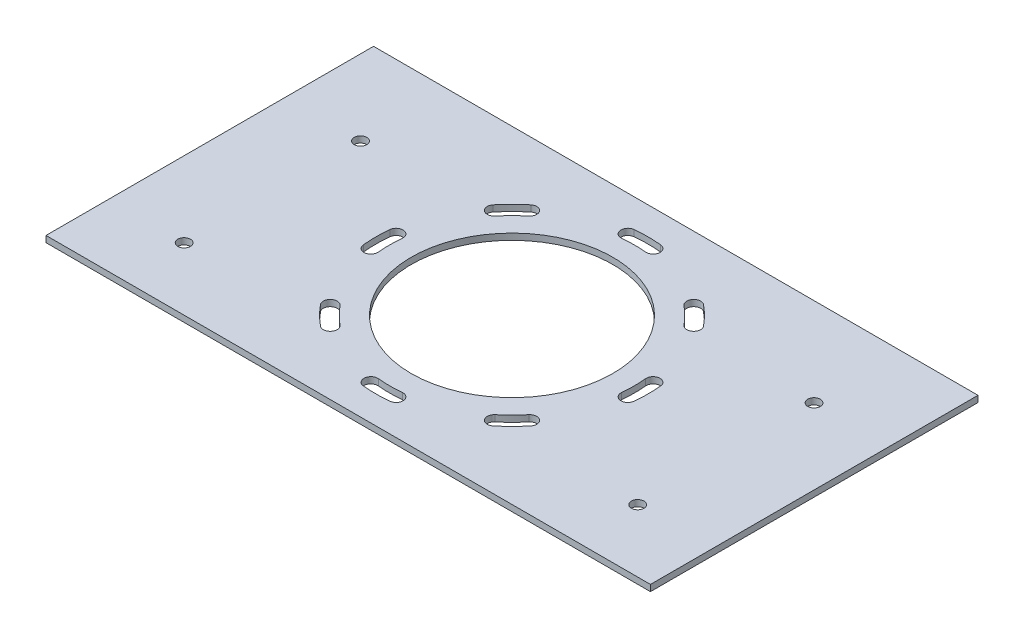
ISO-10303-21;
HEADER;
FILE_DESCRIPTION(('STEP AP214'),'2;1');
FILE_NAME('part.step','',(''),(''),'','','');
FILE_SCHEMA(('AUTOMOTIVE_DESIGN { 1 0 10303 214 1 1 1 1 }'));
ENDSEC;
DATA;
#1=APPLICATION_CONTEXT('core data for automotive mechanical design processes');
#2=APPLICATION_PROTOCOL_DEFINITION('international standard','automotive_design',2000,#1);
#3=PRODUCT_CONTEXT('',#1,'mechanical');
#4=PRODUCT('Part','Part','',(#3));
#5=PRODUCT_RELATED_PRODUCT_CATEGORY('part','',(#4));
#6=PRODUCT_DEFINITION_FORMATION('','',#4);
#7=PRODUCT_DEFINITION_CONTEXT('part definition',#1,'design');
#8=PRODUCT_DEFINITION('design','',#6,#7);
#9=PRODUCT_DEFINITION_SHAPE('','',#8);
#10=(LENGTH_UNIT() NAMED_UNIT(*) SI_UNIT(.MILLI.,.METRE.));
#11=(NAMED_UNIT(*) PLANE_ANGLE_UNIT() SI_UNIT($,.RADIAN.));
#12=(NAMED_UNIT(*) SI_UNIT($,.STERADIAN.) SOLID_ANGLE_UNIT());
#13=UNCERTAINTY_MEASURE_WITH_UNIT(LENGTH_MEASURE(1.E-05),#10,'distance_accuracy_value','');
#14=(GEOMETRIC_REPRESENTATION_CONTEXT(3) GLOBAL_UNCERTAINTY_ASSIGNED_CONTEXT((#13)) GLOBAL_UNIT_ASSIGNED_CONTEXT((#10,
#11,#12)) REPRESENTATION_CONTEXT('',''));
#15=CARTESIAN_POINT('',(0.,0.,0.));
#16=DIRECTION('',(0.,0.,1.));
#17=DIRECTION('',(1.,0.,0.));
#18=AXIS2_PLACEMENT_3D('',#15,#16,#17);
#19=CARTESIAN_POINT('',(0.,405.387122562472,-1.35788972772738E-13));
#20=DIRECTION('',(0.,-1.,0.));
#21=DIRECTION('',(0.,0.,-1.));
#22=AXIS2_PLACEMENT_3D('',#19,#20,#21);
#23=PLANE('',#22);
#24=CARTESIAN_POINT('',(-759.871620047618,405.387122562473,1173.53915146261));
#25=DIRECTION('',(0.,1.,0.));
#26=DIRECTION('',(0.,0.,1.));
#27=AXIS2_PLACEMENT_3D('',#24,#25,#26);
#28=CIRCLE('',#27,50.8);
#29=CARTESIAN_POINT('',(-759.871620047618,405.387122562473,1224.33915146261));
#30=VERTEX_POINT('',#29);
#31=EDGE_CURVE('E298',#30,#30,#28,.T.);
#32=ORIENTED_EDGE('',*,*,#31,.F.);
#33=EDGE_LOOP('',(#32));
#34=FACE_BOUND('',#33,.T.);
#35=CARTESIAN_POINT('',(-759.871620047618,405.387122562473,1173.53915146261));
#36=DIRECTION('',(0.,1.,0.));
#37=DIRECTION('',(0.,0.,1.));
#38=AXIS2_PLACEMENT_3D('',#35,#36,#37);
#39=CIRCLE('',#38,68.5813963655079);
#40=CARTESIAN_POINT('',(-753.180895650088,405.387122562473,1105.28490518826));
#41=VERTEX_POINT('',#40);
#42=CARTESIAN_POINT('',(-766.562344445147,405.387122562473,1105.28490518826));
#43=VERTEX_POINT('',#42);
#44=EDGE_CURVE('E304',#41,#43,#39,.T.);
#45=ORIENTED_EDGE('',*,*,#44,.F.);
#46=CARTESIAN_POINT('',(-753.521620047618,405.387122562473,1108.76074510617));
#47=DIRECTION('',(0.,1.,0.));
#48=DIRECTION('',(0.,0.,1.));
#49=AXIS2_PLACEMENT_3D('',#46,#47,#48);
#50=CIRCLE('',#49,3.4925);
#51=CARTESIAN_POINT('',(-753.862344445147,405.387122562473,1112.23658502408));
#52=VERTEX_POINT('',#51);
#53=EDGE_CURVE('E53',#52,#41,#50,.T.);
#54=ORIENTED_EDGE('',*,*,#53,.F.);
#55=CARTESIAN_POINT('',(-759.871620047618,405.387122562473,1173.53915146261));
#56=DIRECTION('',(0.,-1.,0.));
#57=DIRECTION('',(0.,0.,1.));
#58=AXIS2_PLACEMENT_3D('',#55,#56,#57);
#59=CIRCLE('',#58,61.5963963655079);
#60=CARTESIAN_POINT('',(-765.880895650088,405.387122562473,1112.23658502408));
#61=VERTEX_POINT('',#60);
#62=EDGE_CURVE('E291',#61,#52,#59,.T.);
#63=ORIENTED_EDGE('',*,*,#62,.F.);
#64=CARTESIAN_POINT('',(-766.221620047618,405.387122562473,1108.76074510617));
#65=DIRECTION('',(0.,1.,0.));
#66=DIRECTION('',(0.,0.,1.));
#67=AXIS2_PLACEMENT_3D('',#64,#65,#66);
#68=CIRCLE('',#67,3.4925);
#69=EDGE_CURVE('E296',#43,#61,#68,.T.);
#70=ORIENTED_EDGE('',*,*,#69,.F.);
#71=EDGE_LOOP('',(#45,#54,#63,#70));
#72=FACE_BOUND('',#71,.T.);
#73=CARTESIAN_POINT('',(-718.556497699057,405.387122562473,1123.24377299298));
#74=DIRECTION('',(0.,1.,0.));
#75=DIRECTION('',(0.,0.,1.));
#76=AXIS2_PLACEMENT_3D('',#73,#74,#75);
#77=CIRCLE('',#76,3.49249999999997);
#78=CARTESIAN_POINT('',(-716.339636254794,405.387122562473,1120.5450544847));
#79=VERTEX_POINT('',#78);
#80=CARTESIAN_POINT('',(-720.77335914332,405.387122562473,1125.94249150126));
#81=VERTEX_POINT('',#80);
#82=EDGE_CURVE('E335',#79,#81,#77,.T.);
#83=ORIENTED_EDGE('',*,*,#82,.F.);
#84=CARTESIAN_POINT('',(-759.871620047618,405.387122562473,1173.53915146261));
#85=DIRECTION('',(0.,1.,0.));
#86=DIRECTION('',(0.,0.,1.));
#87=AXIS2_PLACEMENT_3D('',#84,#85,#86);
#88=CIRCLE('',#87,68.5813963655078);
#89=CARTESIAN_POINT('',(-706.877523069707,405.387122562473,1130.00716766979));
#90=VERTEX_POINT('',#89);
#91=EDGE_CURVE('E62',#90,#79,#88,.T.);
#92=ORIENTED_EDGE('',*,*,#91,.F.);
#93=CARTESIAN_POINT('',(-709.576241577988,405.387122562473,1132.22402911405));
#94=DIRECTION('',(0.,1.,0.));
#95=DIRECTION('',(0.,0.,1.));
#96=AXIS2_PLACEMENT_3D('',#93,#94,#95);
#97=CIRCLE('',#96,3.49249999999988);
#98=CARTESIAN_POINT('',(-712.274960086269,405.387122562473,1134.44089055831));
#99=VERTEX_POINT('',#98);
#100=EDGE_CURVE('E324',#99,#90,#97,.T.);
#101=ORIENTED_EDGE('',*,*,#100,.F.);
#102=CARTESIAN_POINT('',(-759.871620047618,405.387122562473,1173.53915146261));
#103=DIRECTION('',(0.,-1.,0.));
#104=DIRECTION('',(0.,0.,1.));
#105=AXIS2_PLACEMENT_3D('',#102,#103,#104);
#106=CIRCLE('',#105,61.5963963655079);
#107=EDGE_CURVE('E327',#81,#99,#106,.T.);
#108=ORIENTED_EDGE('',*,*,#107,.F.);
#109=EDGE_LOOP('',(#83,#92,#101,#108));
#110=FACE_BOUND('',#109,.T.);
#111=CARTESIAN_POINT('',(-695.09321369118,405.387122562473,1167.18915146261));
#112=DIRECTION('',(0.,1.,0.));
#113=DIRECTION('',(0.,0.,1.));
#114=AXIS2_PLACEMENT_3D('',#111,#112,#113);
#115=CIRCLE('',#114,3.49249999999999);
#116=CARTESIAN_POINT('',(-691.617373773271,405.387122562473,1166.84842706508));
#117=VERTEX_POINT('',#116);
#118=CARTESIAN_POINT('',(-698.569053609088,405.387122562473,1167.52987586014));
#119=VERTEX_POINT('',#118);
#120=EDGE_CURVE('E365',#117,#119,#115,.T.);
#121=ORIENTED_EDGE('',*,*,#120,.F.);
#122=CARTESIAN_POINT('',(-759.871620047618,405.387122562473,1173.53915146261));
#123=DIRECTION('',(0.,1.,0.));
#124=DIRECTION('',(0.,0.,1.));
#125=AXIS2_PLACEMENT_3D('',#122,#123,#124);
#126=CIRCLE('',#125,68.581396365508);
#127=CARTESIAN_POINT('',(-691.617373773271,405.387122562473,1180.22987586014));
#128=VERTEX_POINT('',#127);
#129=EDGE_CURVE('E322',#128,#117,#126,.T.);
#130=ORIENTED_EDGE('',*,*,#129,.F.);
#131=CARTESIAN_POINT('',(-695.09321369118,405.387122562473,1179.88915146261));
#132=DIRECTION('',(0.,1.,0.));
#133=DIRECTION('',(0.,0.,1.));
#134=AXIS2_PLACEMENT_3D('',#131,#132,#133);
#135=CIRCLE('',#134,3.4925);
#136=CARTESIAN_POINT('',(-698.569053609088,405.387122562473,1179.54842706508));
#137=VERTEX_POINT('',#136);
#138=EDGE_CURVE('E360',#137,#128,#135,.T.);
#139=ORIENTED_EDGE('',*,*,#138,.F.);
#140=CARTESIAN_POINT('',(-759.871620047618,405.387122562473,1173.53915146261));
#141=DIRECTION('',(0.,-1.,0.));
#142=DIRECTION('',(0.,0.,1.));
#143=AXIS2_PLACEMENT_3D('',#140,#141,#142);
#144=CIRCLE('',#143,61.596396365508);
#145=EDGE_CURVE('E359',#119,#137,#144,.T.);
#146=ORIENTED_EDGE('',*,*,#145,.F.);
#147=EDGE_LOOP('',(#121,#130,#139,#146));
#148=FACE_BOUND('',#147,.T.);
#149=CARTESIAN_POINT('',(-709.576241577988,405.387122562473,1214.85427381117));
#150=DIRECTION('',(0.,1.,0.));
#151=DIRECTION('',(0.,0.,1.));
#152=AXIS2_PLACEMENT_3D('',#149,#150,#151);
#153=CIRCLE('',#152,3.49249999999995);
#154=CARTESIAN_POINT('',(-706.877523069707,405.387122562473,1217.07113525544));
#155=VERTEX_POINT('',#154);
#156=CARTESIAN_POINT('',(-712.274960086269,405.387122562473,1212.63741236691));
#157=VERTEX_POINT('',#156);
#158=EDGE_CURVE('E396',#155,#157,#153,.T.);
#159=ORIENTED_EDGE('',*,*,#158,.F.);
#160=CARTESIAN_POINT('',(-759.871620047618,405.387122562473,1173.53915146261));
#161=DIRECTION('',(0.,1.,0.));
#162=DIRECTION('',(0.,0.,1.));
#163=AXIS2_PLACEMENT_3D('',#160,#161,#162);
#164=CIRCLE('',#163,68.5813963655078);
#165=CARTESIAN_POINT('',(-716.339636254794,405.387122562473,1226.53324844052));
#166=VERTEX_POINT('',#165);
#167=EDGE_CURVE('E356',#166,#155,#164,.T.);
#168=ORIENTED_EDGE('',*,*,#167,.F.);
#169=CARTESIAN_POINT('',(-718.556497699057,405.387122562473,1223.83452993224));
#170=DIRECTION('',(0.,1.,0.));
#171=DIRECTION('',(0.,0.,1.));
#172=AXIS2_PLACEMENT_3D('',#169,#170,#171);
#173=CIRCLE('',#172,3.49249999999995);
#174=CARTESIAN_POINT('',(-720.77335914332,405.387122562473,1221.13581142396));
#175=VERTEX_POINT('',#174);
#176=EDGE_CURVE('E386',#175,#166,#173,.T.);
#177=ORIENTED_EDGE('',*,*,#176,.F.);
#178=CARTESIAN_POINT('',(-759.871620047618,405.387122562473,1173.53915146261));
#179=DIRECTION('',(0.,-1.,0.));
#180=DIRECTION('',(0.,0.,1.));
#181=AXIS2_PLACEMENT_3D('',#178,#179,#180);
#182=CIRCLE('',#181,61.5963963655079);
#183=EDGE_CURVE('E392',#157,#175,#182,.T.);
#184=ORIENTED_EDGE('',*,*,#183,.F.);
#185=EDGE_LOOP('',(#159,#168,#177,#184));
#186=FACE_BOUND('',#185,.T.);
#187=CARTESIAN_POINT('',(-753.521620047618,405.387122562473,1238.31755781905));
#188=DIRECTION('',(0.,1.,0.));
#189=DIRECTION('',(0.,0.,1.));
#190=AXIS2_PLACEMENT_3D('',#187,#188,#189);
#191=CIRCLE('',#190,3.4925);
#192=CARTESIAN_POINT('',(-753.180895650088,405.387122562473,1241.79339773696));
#193=VERTEX_POINT('',#192);
#194=CARTESIAN_POINT('',(-753.862344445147,405.387122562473,1234.84171790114));
#195=VERTEX_POINT('',#194);
#196=EDGE_CURVE('E428',#193,#195,#191,.T.);
#197=ORIENTED_EDGE('',*,*,#196,.F.);
#198=CARTESIAN_POINT('',(-759.871620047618,405.387122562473,1173.53915146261));
#199=DIRECTION('',(0.,1.,0.));
#200=DIRECTION('',(0.,0.,1.));
#201=AXIS2_PLACEMENT_3D('',#198,#199,#200);
#202=CIRCLE('',#201,68.5813963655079);
#203=CARTESIAN_POINT('',(-766.562344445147,405.387122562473,1241.79339773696));
#204=VERTEX_POINT('',#203);
#205=EDGE_CURVE('E389',#204,#193,#202,.T.);
#206=ORIENTED_EDGE('',*,*,#205,.F.);
#207=CARTESIAN_POINT('',(-766.221620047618,405.387122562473,1238.31755781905));
#208=DIRECTION('',(0.,1.,0.));
#209=DIRECTION('',(0.,0.,1.));
#210=AXIS2_PLACEMENT_3D('',#207,#208,#209);
#211=CIRCLE('',#210,3.4925);
#212=CARTESIAN_POINT('',(-765.880895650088,405.387122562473,1234.84171790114));
#213=VERTEX_POINT('',#212);
#214=EDGE_CURVE('E423',#213,#204,#211,.T.);
#215=ORIENTED_EDGE('',*,*,#214,.F.);
#216=CARTESIAN_POINT('',(-759.871620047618,405.387122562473,1173.53915146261));
#217=DIRECTION('',(0.,-1.,0.));
#218=DIRECTION('',(0.,0.,1.));
#219=AXIS2_PLACEMENT_3D('',#216,#217,#218);
#220=CIRCLE('',#219,61.5963963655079);
#221=EDGE_CURVE('E424',#195,#213,#220,.T.);
#222=ORIENTED_EDGE('',*,*,#221,.F.);
#223=EDGE_LOOP('',(#197,#206,#215,#222));
#224=FACE_BOUND('',#223,.T.);
#225=CARTESIAN_POINT('',(-801.186742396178,405.387122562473,1223.83452993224));
#226=DIRECTION('',(0.,1.,0.));
#227=DIRECTION('',(0.,0.,1.));
#228=AXIS2_PLACEMENT_3D('',#225,#226,#227);
#229=CIRCLE('',#228,3.49249999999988);
#230=CARTESIAN_POINT('',(-803.403603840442,405.387122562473,1226.53324844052));
#231=VERTEX_POINT('',#230);
#232=CARTESIAN_POINT('',(-798.969880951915,405.387122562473,1221.13581142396));
#233=VERTEX_POINT('',#232);
#234=EDGE_CURVE('E458',#231,#233,#229,.T.);
#235=ORIENTED_EDGE('',*,*,#234,.F.);
#236=CARTESIAN_POINT('',(-759.871620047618,405.387122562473,1173.53915146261));
#237=DIRECTION('',(0.,1.,0.));
#238=DIRECTION('',(0.,0.,1.));
#239=AXIS2_PLACEMENT_3D('',#236,#237,#238);
#240=CIRCLE('',#239,68.5813963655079);
#241=CARTESIAN_POINT('',(-812.865717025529,405.387122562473,1217.07113525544));
#242=VERTEX_POINT('',#241);
#243=EDGE_CURVE('E419',#242,#231,#240,.T.);
#244=ORIENTED_EDGE('',*,*,#243,.F.);
#245=CARTESIAN_POINT('',(-810.166998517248,405.387122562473,1214.85427381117));
#246=DIRECTION('',(0.,1.,0.));
#247=DIRECTION('',(0.,0.,1.));
#248=AXIS2_PLACEMENT_3D('',#245,#246,#247);
#249=CIRCLE('',#248,3.49250000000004);
#250=CARTESIAN_POINT('',(-807.468280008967,405.387122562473,1212.63741236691));
#251=VERTEX_POINT('',#250);
#252=EDGE_CURVE('E453',#251,#242,#249,.T.);
#253=ORIENTED_EDGE('',*,*,#252,.F.);
#254=CARTESIAN_POINT('',(-759.871620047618,405.387122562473,1173.53915146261));
#255=DIRECTION('',(0.,-1.,0.));
#256=DIRECTION('',(0.,0.,1.));
#257=AXIS2_PLACEMENT_3D('',#254,#255,#256);
#258=CIRCLE('',#257,61.596396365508);
#259=EDGE_CURVE('E457',#233,#251,#258,.T.);
#260=ORIENTED_EDGE('',*,*,#259,.F.);
#261=EDGE_LOOP('',(#235,#244,#253,#260));
#262=FACE_BOUND('',#261,.T.);
#263=CARTESIAN_POINT('',(-824.650026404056,405.387122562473,1179.88915146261));
#264=DIRECTION('',(0.,1.,0.));
#265=DIRECTION('',(0.,0.,1.));
#266=AXIS2_PLACEMENT_3D('',#263,#264,#265);
#267=CIRCLE('',#266,3.49249999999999);
#268=CARTESIAN_POINT('',(-828.125866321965,405.387122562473,1180.22987586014));
#269=VERTEX_POINT('',#268);
#270=CARTESIAN_POINT('',(-821.174186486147,405.387122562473,1179.54842706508));
#271=VERTEX_POINT('',#270);
#272=EDGE_CURVE('E495',#269,#271,#267,.T.);
#273=ORIENTED_EDGE('',*,*,#272,.F.);
#274=CARTESIAN_POINT('',(-759.871620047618,405.387122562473,1173.53915146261));
#275=DIRECTION('',(0.,1.,0.));
#276=DIRECTION('',(0.,0.,1.));
#277=AXIS2_PLACEMENT_3D('',#274,#275,#276);
#278=CIRCLE('',#277,68.5813963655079);
#279=CARTESIAN_POINT('',(-828.125866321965,405.387122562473,1166.84842706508));
#280=VERTEX_POINT('',#279);
#281=EDGE_CURVE('E455',#280,#269,#278,.T.);
#282=ORIENTED_EDGE('',*,*,#281,.F.);
#283=CARTESIAN_POINT('',(-824.650026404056,405.387122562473,1167.18915146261));
#284=DIRECTION('',(0.,1.,0.));
#285=DIRECTION('',(0.,0.,1.));
#286=AXIS2_PLACEMENT_3D('',#283,#284,#285);
#287=CIRCLE('',#286,3.49249999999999);
#288=CARTESIAN_POINT('',(-821.174186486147,405.387122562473,1167.52987586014));
#289=VERTEX_POINT('',#288);
#290=EDGE_CURVE('E484',#289,#280,#287,.T.);
#291=ORIENTED_EDGE('',*,*,#290,.F.);
#292=CARTESIAN_POINT('',(-759.871620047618,405.387122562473,1173.53915146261));
#293=DIRECTION('',(0.,-1.,0.));
#294=DIRECTION('',(0.,0.,1.));
#295=AXIS2_PLACEMENT_3D('',#292,#293,#294);
#296=CIRCLE('',#295,61.5963963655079);
#297=EDGE_CURVE('E488',#271,#289,#296,.T.);
#298=ORIENTED_EDGE('',*,*,#297,.F.);
#299=EDGE_LOOP('',(#273,#282,#291,#298));
#300=FACE_BOUND('',#299,.T.);
#301=CARTESIAN_POINT('',(-810.166998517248,405.387122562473,1132.22402911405));
#302=DIRECTION('',(0.,1.,0.));
#303=DIRECTION('',(0.,0.,1.));
#304=AXIS2_PLACEMENT_3D('',#301,#302,#303);
#305=CIRCLE('',#304,3.49250000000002);
#306=CARTESIAN_POINT('',(-812.865717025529,405.387122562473,1130.00716766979));
#307=VERTEX_POINT('',#306);
#308=CARTESIAN_POINT('',(-807.468280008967,405.387122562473,1134.44089055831));
#309=VERTEX_POINT('',#308);
#310=EDGE_CURVE('E522',#307,#309,#305,.T.);
#311=ORIENTED_EDGE('',*,*,#310,.F.);
#312=CARTESIAN_POINT('',(-759.871620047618,405.387122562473,1173.53915146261));
#313=DIRECTION('',(0.,1.,0.));
#314=DIRECTION('',(0.,0.,1.));
#315=AXIS2_PLACEMENT_3D('',#312,#313,#314);
#316=CIRCLE('',#315,68.5813963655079);
#317=CARTESIAN_POINT('',(-803.403603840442,405.387122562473,1120.5450544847));
#318=VERTEX_POINT('',#317);
#319=EDGE_CURVE('E482',#318,#307,#316,.T.);
#320=ORIENTED_EDGE('',*,*,#319,.F.);
#321=CARTESIAN_POINT('',(-801.186742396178,405.387122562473,1123.24377299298));
#322=DIRECTION('',(0.,1.,0.));
#323=DIRECTION('',(0.,0.,1.));
#324=AXIS2_PLACEMENT_3D('',#321,#322,#323);
#325=CIRCLE('',#324,3.49249999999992);
#326=CARTESIAN_POINT('',(-798.969880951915,405.387122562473,1125.94249150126));
#327=VERTEX_POINT('',#326);
#328=EDGE_CURVE('E517',#327,#318,#325,.T.);
#329=ORIENTED_EDGE('',*,*,#328,.F.);
#330=CARTESIAN_POINT('',(-759.871620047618,405.387122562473,1173.53915146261));
#331=DIRECTION('',(0.,-1.,0.));
#332=DIRECTION('',(0.,0.,1.));
#333=AXIS2_PLACEMENT_3D('',#330,#331,#332);
#334=CIRCLE('',#333,61.596396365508);
#335=EDGE_CURVE('E520',#309,#327,#334,.T.);
#336=ORIENTED_EDGE('',*,*,#335,.F.);
#337=EDGE_LOOP('',(#311,#320,#329,#336));
#338=FACE_BOUND('',#337,.T.);
#339=DIRECTION('',(0.,0.,1.));
#340=VECTOR('',#339,1.);
#341=CARTESIAN_POINT('',(-912.202870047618,405.387122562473,1256.08915146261));
#342=LINE('',#341,#340);
#343=CARTESIAN_POINT('',(-912.202870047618,405.387122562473,1090.98915146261));
#344=VERTEX_POINT('',#343);
#345=CARTESIAN_POINT('',(-912.202870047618,405.387122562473,1256.08915146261));
#346=VERTEX_POINT('',#345);
#347=EDGE_CURVE('E565',#344,#346,#342,.T.);
#348=ORIENTED_EDGE('',*,*,#347,.T.);
#349=DIRECTION('',(1.,0.,0.));
#350=VECTOR('',#349,1.);
#351=CARTESIAN_POINT('',(-912.202870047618,405.387122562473,1256.08915146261));
#352=LINE('',#351,#350);
#353=CARTESIAN_POINT('',(-607.540370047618,405.387122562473,1256.08915146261));
#354=VERTEX_POINT('',#353);
#355=EDGE_CURVE('E564',#346,#354,#352,.T.);
#356=ORIENTED_EDGE('',*,*,#355,.T.);
#357=DIRECTION('',(0.,0.,-1.));
#358=VECTOR('',#357,1.);
#359=CARTESIAN_POINT('',(-607.540370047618,405.387122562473,1256.08915146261));
#360=LINE('',#359,#358);
#361=CARTESIAN_POINT('',(-607.540370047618,405.387122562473,1090.98915146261));
#362=VERTEX_POINT('',#361);
#363=EDGE_CURVE('E566',#354,#362,#360,.T.);
#364=ORIENTED_EDGE('',*,*,#363,.T.);
#365=DIRECTION('',(-1.,0.,0.));
#366=VECTOR('',#365,1.);
#367=CARTESIAN_POINT('',(-912.202870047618,405.387122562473,1090.98915146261));
#368=LINE('',#367,#366);
#369=EDGE_CURVE('E568',#362,#344,#368,.T.);
#370=ORIENTED_EDGE('',*,*,#369,.T.);
#371=EDGE_LOOP('',(#348,#356,#364,#370));
#372=FACE_BOUND('',#371,.T.);
#373=CARTESIAN_POINT('',(-874.171620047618,405.387122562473,1135.60325221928));
#374=DIRECTION('',(0.,1.,0.));
#375=DIRECTION('',(0.,0.,1.));
#376=AXIS2_PLACEMENT_3D('',#373,#374,#375);
#377=CIRCLE('',#376,3.17500000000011);
#378=CARTESIAN_POINT('',(-874.171620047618,405.387122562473,1138.77825221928));
#379=VERTEX_POINT('',#378);
#380=EDGE_CURVE('E556',#379,#379,#377,.T.);
#381=ORIENTED_EDGE('',*,*,#380,.F.);
#382=EDGE_LOOP('',(#381));
#383=FACE_BOUND('',#382,.T.);
#384=CARTESIAN_POINT('',(-874.171620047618,405.387122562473,1224.50325221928));
#385=DIRECTION('',(0.,1.,0.));
#386=DIRECTION('',(0.,0.,1.));
#387=AXIS2_PLACEMENT_3D('',#384,#385,#386);
#388=CIRCLE('',#387,3.17500000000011);
#389=CARTESIAN_POINT('',(-874.171620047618,405.387122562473,1227.67825221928));
#390=VERTEX_POINT('',#389);
#391=EDGE_CURVE('E549',#390,#390,#388,.T.);
#392=ORIENTED_EDGE('',*,*,#391,.F.);
#393=EDGE_LOOP('',(#392));
#394=FACE_BOUND('',#393,.T.);
#395=CARTESIAN_POINT('',(-645.571620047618,405.387122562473,1224.50325221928));
#396=DIRECTION('',(0.,1.,0.));
#397=DIRECTION('',(0.,0.,1.));
#398=AXIS2_PLACEMENT_3D('',#395,#396,#397);
#399=CIRCLE('',#398,3.17500000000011);
#400=CARTESIAN_POINT('',(-645.571620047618,405.387122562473,1227.67825221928));
#401=VERTEX_POINT('',#400);
#402=EDGE_CURVE('E542',#401,#401,#399,.T.);
#403=ORIENTED_EDGE('',*,*,#402,.F.);
#404=EDGE_LOOP('',(#403));
#405=FACE_BOUND('',#404,.T.);
#406=CARTESIAN_POINT('',(-645.571620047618,405.387122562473,1135.60325221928));
#407=DIRECTION('',(0.,1.,0.));
#408=DIRECTION('',(0.,0.,1.));
#409=AXIS2_PLACEMENT_3D('',#406,#407,#408);
#410=CIRCLE('',#409,3.17499999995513);
#411=CARTESIAN_POINT('',(-645.571620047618,405.387122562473,1138.77825221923));
#412=VERTEX_POINT('',#411);
#413=EDGE_CURVE('E538',#412,#412,#410,.T.);
#414=ORIENTED_EDGE('',*,*,#413,.F.);
#415=EDGE_LOOP('',(#414));
#416=FACE_BOUND('',#415,.T.);
#417=ADVANCED_FACE('F39',(#34,#72,#110,#148,#186,#224,#262,#300,#338,#372,#383,#394,#405,#416),
#23,.F.);
#418=CARTESIAN_POINT('',(0.,402.212122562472,-1.3523475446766E-13));
#419=DIRECTION('',(0.,-1.,0.));
#420=DIRECTION('',(0.,0.,-1.));
#421=AXIS2_PLACEMENT_3D('',#418,#419,#420);
#422=PLANE('',#421);
#423=CARTESIAN_POINT('',(-759.871620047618,402.212122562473,1173.53915146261));
#424=DIRECTION('',(0.,1.,0.));
#425=DIRECTION('',(0.,0.,1.));
#426=AXIS2_PLACEMENT_3D('',#423,#424,#425);
#427=CIRCLE('',#426,50.8);
#428=CARTESIAN_POINT('',(-759.871620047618,402.212122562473,1224.33915146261));
#429=VERTEX_POINT('',#428);
#430=EDGE_CURVE('E516',#429,#429,#427,.T.);
#431=ORIENTED_EDGE('',*,*,#430,.T.);
#432=EDGE_LOOP('',(#431));
#433=FACE_BOUND('',#432,.T.);
#434=CARTESIAN_POINT('',(-753.521620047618,402.212122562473,1108.76074510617));
#435=DIRECTION('',(0.,1.,0.));
#436=DIRECTION('',(0.,0.,1.));
#437=AXIS2_PLACEMENT_3D('',#434,#435,#436);
#438=CIRCLE('',#437,3.4925);
#439=CARTESIAN_POINT('',(-753.862344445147,402.212122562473,1112.23658502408));
#440=VERTEX_POINT('',#439);
#441=CARTESIAN_POINT('',(-753.180895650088,402.212122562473,1105.28490518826));
#442=VERTEX_POINT('',#441);
#443=EDGE_CURVE('E273',#440,#442,#438,.T.);
#444=ORIENTED_EDGE('',*,*,#443,.T.);
#445=CARTESIAN_POINT('',(-759.871620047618,402.212122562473,1173.53915146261));
#446=DIRECTION('',(0.,1.,0.));
#447=DIRECTION('',(0.,0.,1.));
#448=AXIS2_PLACEMENT_3D('',#445,#446,#447);
#449=CIRCLE('',#448,68.5813963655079);
#450=CARTESIAN_POINT('',(-766.562344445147,402.212122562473,1105.28490518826));
#451=VERTEX_POINT('',#450);
#452=EDGE_CURVE('E283',#442,#451,#449,.T.);
#453=ORIENTED_EDGE('',*,*,#452,.T.);
#454=CARTESIAN_POINT('',(-766.221620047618,402.212122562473,1108.76074510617));
#455=DIRECTION('',(0.,1.,0.));
#456=DIRECTION('',(0.,0.,1.));
#457=AXIS2_PLACEMENT_3D('',#454,#455,#456);
#458=CIRCLE('',#457,3.4925);
#459=CARTESIAN_POINT('',(-765.880895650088,402.212122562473,1112.23658502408));
#460=VERTEX_POINT('',#459);
#461=EDGE_CURVE('E288',#451,#460,#458,.T.);
#462=ORIENTED_EDGE('',*,*,#461,.T.);
#463=CARTESIAN_POINT('',(-759.871620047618,402.212122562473,1173.53915146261));
#464=DIRECTION('',(0.,-1.,0.));
#465=DIRECTION('',(0.,0.,1.));
#466=AXIS2_PLACEMENT_3D('',#463,#464,#465);
#467=CIRCLE('',#466,61.5963963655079);
#468=EDGE_CURVE('E278',#460,#440,#467,.T.);
#469=ORIENTED_EDGE('',*,*,#468,.T.);
#470=EDGE_LOOP('',(#444,#453,#462,#469));
#471=FACE_BOUND('',#470,.T.);
#472=CARTESIAN_POINT('',(-759.871620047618,402.212122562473,1173.53915146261));
#473=DIRECTION('',(0.,1.,0.));
#474=DIRECTION('',(0.,0.,1.));
#475=AXIS2_PLACEMENT_3D('',#472,#473,#474);
#476=CIRCLE('',#475,68.5813963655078);
#477=CARTESIAN_POINT('',(-706.877523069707,402.212122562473,1130.00716766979));
#478=VERTEX_POINT('',#477);
#479=CARTESIAN_POINT('',(-716.339636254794,402.212122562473,1120.5450544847));
#480=VERTEX_POINT('',#479);
#481=EDGE_CURVE('E328',#478,#480,#476,.T.);
#482=ORIENTED_EDGE('',*,*,#481,.T.);
#483=CARTESIAN_POINT('',(-718.556497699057,402.212122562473,1123.24377299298));
#484=DIRECTION('',(0.,1.,0.));
#485=DIRECTION('',(0.,0.,1.));
#486=AXIS2_PLACEMENT_3D('',#483,#484,#485);
#487=CIRCLE('',#486,3.49249999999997);
#488=CARTESIAN_POINT('',(-720.77335914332,402.212122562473,1125.94249150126));
#489=VERTEX_POINT('',#488);
#490=EDGE_CURVE('E341',#480,#489,#487,.T.);
#491=ORIENTED_EDGE('',*,*,#490,.T.);
#492=CARTESIAN_POINT('',(-759.871620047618,402.212122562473,1173.53915146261));
#493=DIRECTION('',(0.,-1.,0.));
#494=DIRECTION('',(0.,0.,1.));
#495=AXIS2_PLACEMENT_3D('',#492,#493,#494);
#496=CIRCLE('',#495,61.5963963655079);
#497=CARTESIAN_POINT('',(-712.274960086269,402.212122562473,1134.44089055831));
#498=VERTEX_POINT('',#497);
#499=EDGE_CURVE('E339',#489,#498,#496,.T.);
#500=ORIENTED_EDGE('',*,*,#499,.T.);
#501=CARTESIAN_POINT('',(-709.576241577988,402.212122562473,1132.22402911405));
#502=DIRECTION('',(0.,1.,0.));
#503=DIRECTION('',(0.,0.,1.));
#504=AXIS2_PLACEMENT_3D('',#501,#502,#503);
#505=CIRCLE('',#504,3.49249999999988);
#506=EDGE_CURVE('E320',#498,#478,#505,.T.);
#507=ORIENTED_EDGE('',*,*,#506,.T.);
#508=EDGE_LOOP('',(#482,#491,#500,#507));
#509=FACE_BOUND('',#508,.T.);
#510=CARTESIAN_POINT('',(-759.871620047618,402.212122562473,1173.53915146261));
#511=DIRECTION('',(0.,1.,0.));
#512=DIRECTION('',(0.,0.,1.));
#513=AXIS2_PLACEMENT_3D('',#510,#511,#512);
#514=CIRCLE('',#513,68.581396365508);
#515=CARTESIAN_POINT('',(-691.617373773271,402.212122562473,1180.22987586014));
#516=VERTEX_POINT('',#515);
#517=CARTESIAN_POINT('',(-691.617373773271,402.212122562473,1166.84842706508));
#518=VERTEX_POINT('',#517);
#519=EDGE_CURVE('E363',#516,#518,#514,.T.);
#520=ORIENTED_EDGE('',*,*,#519,.T.);
#521=CARTESIAN_POINT('',(-695.09321369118,402.212122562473,1167.18915146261));
#522=DIRECTION('',(0.,1.,0.));
#523=DIRECTION('',(0.,0.,1.));
#524=AXIS2_PLACEMENT_3D('',#521,#522,#523);
#525=CIRCLE('',#524,3.49249999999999);
#526=CARTESIAN_POINT('',(-698.569053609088,402.212122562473,1167.52987586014));
#527=VERTEX_POINT('',#526);
#528=EDGE_CURVE('E373',#518,#527,#525,.T.);
#529=ORIENTED_EDGE('',*,*,#528,.T.);
#530=CARTESIAN_POINT('',(-759.871620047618,402.212122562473,1173.53915146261));
#531=DIRECTION('',(0.,-1.,0.));
#532=DIRECTION('',(0.,0.,1.));
#533=AXIS2_PLACEMENT_3D('',#530,#531,#532);
#534=CIRCLE('',#533,61.596396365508);
#535=CARTESIAN_POINT('',(-698.569053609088,402.212122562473,1179.54842706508));
#536=VERTEX_POINT('',#535);
#537=EDGE_CURVE('E367',#527,#536,#534,.T.);
#538=ORIENTED_EDGE('',*,*,#537,.T.);
#539=CARTESIAN_POINT('',(-695.09321369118,402.212122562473,1179.88915146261));
#540=DIRECTION('',(0.,1.,0.));
#541=DIRECTION('',(0.,0.,1.));
#542=AXIS2_PLACEMENT_3D('',#539,#540,#541);
#543=CIRCLE('',#542,3.4925);
#544=EDGE_CURVE('E349',#536,#516,#543,.T.);
#545=ORIENTED_EDGE('',*,*,#544,.T.);
#546=EDGE_LOOP('',(#520,#529,#538,#545));
#547=FACE_BOUND('',#546,.T.);
#548=CARTESIAN_POINT('',(-759.871620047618,402.212122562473,1173.53915146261));
#549=DIRECTION('',(0.,1.,0.));
#550=DIRECTION('',(0.,0.,1.));
#551=AXIS2_PLACEMENT_3D('',#548,#549,#550);
#552=CIRCLE('',#551,68.5813963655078);
#553=CARTESIAN_POINT('',(-716.339636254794,402.212122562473,1226.53324844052));
#554=VERTEX_POINT('',#553);
#555=CARTESIAN_POINT('',(-706.877523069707,402.212122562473,1217.07113525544));
#556=VERTEX_POINT('',#555);
#557=EDGE_CURVE('E394',#554,#556,#552,.T.);
#558=ORIENTED_EDGE('',*,*,#557,.T.);
#559=CARTESIAN_POINT('',(-709.576241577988,402.212122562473,1214.85427381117));
#560=DIRECTION('',(0.,1.,0.));
#561=DIRECTION('',(0.,0.,1.));
#562=AXIS2_PLACEMENT_3D('',#559,#560,#561);
#563=CIRCLE('',#562,3.49249999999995);
#564=CARTESIAN_POINT('',(-712.274960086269,402.212122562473,1212.63741236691));
#565=VERTEX_POINT('',#564);
#566=EDGE_CURVE('E403',#556,#565,#563,.T.);
#567=ORIENTED_EDGE('',*,*,#566,.T.);
#568=CARTESIAN_POINT('',(-759.871620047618,402.212122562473,1173.53915146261));
#569=DIRECTION('',(0.,-1.,0.));
#570=DIRECTION('',(0.,0.,1.));
#571=AXIS2_PLACEMENT_3D('',#568,#569,#570);
#572=CIRCLE('',#571,61.5963963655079);
#573=CARTESIAN_POINT('',(-720.77335914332,402.212122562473,1221.13581142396));
#574=VERTEX_POINT('',#573);
#575=EDGE_CURVE('E405',#565,#574,#572,.T.);
#576=ORIENTED_EDGE('',*,*,#575,.T.);
#577=CARTESIAN_POINT('',(-718.556497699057,402.212122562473,1223.83452993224));
#578=DIRECTION('',(0.,1.,0.));
#579=DIRECTION('',(0.,0.,1.));
#580=AXIS2_PLACEMENT_3D('',#577,#578,#579);
#581=CIRCLE('',#580,3.49249999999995);
#582=EDGE_CURVE('E381',#574,#554,#581,.T.);
#583=ORIENTED_EDGE('',*,*,#582,.T.);
#584=EDGE_LOOP('',(#558,#567,#576,#583));
#585=FACE_BOUND('',#584,.T.);
#586=CARTESIAN_POINT('',(-759.871620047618,402.212122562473,1173.53915146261));
#587=DIRECTION('',(0.,1.,0.));
#588=DIRECTION('',(0.,0.,1.));
#589=AXIS2_PLACEMENT_3D('',#586,#587,#588);
#590=CIRCLE('',#589,68.5813963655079);
#591=CARTESIAN_POINT('',(-766.562344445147,402.212122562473,1241.79339773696));
#592=VERTEX_POINT('',#591);
#593=CARTESIAN_POINT('',(-753.180895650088,402.212122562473,1241.79339773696));
#594=VERTEX_POINT('',#593);
#595=EDGE_CURVE('E422',#592,#594,#590,.T.);
#596=ORIENTED_EDGE('',*,*,#595,.T.);
#597=CARTESIAN_POINT('',(-753.521620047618,402.212122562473,1238.31755781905));
#598=DIRECTION('',(0.,1.,0.));
#599=DIRECTION('',(0.,0.,1.));
#600=AXIS2_PLACEMENT_3D('',#597,#598,#599);
#601=CIRCLE('',#600,3.4925);
#602=CARTESIAN_POINT('',(-753.862344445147,402.212122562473,1234.84171790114));
#603=VERTEX_POINT('',#602);
#604=EDGE_CURVE('E440',#594,#603,#601,.T.);
#605=ORIENTED_EDGE('',*,*,#604,.T.);
#606=CARTESIAN_POINT('',(-759.871620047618,402.212122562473,1173.53915146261));
#607=DIRECTION('',(0.,-1.,0.));
#608=DIRECTION('',(0.,0.,1.));
#609=AXIS2_PLACEMENT_3D('',#606,#607,#608);
#610=CIRCLE('',#609,61.5963963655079);
#611=CARTESIAN_POINT('',(-765.880895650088,402.212122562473,1234.84171790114));
#612=VERTEX_POINT('',#611);
#613=EDGE_CURVE('E432',#603,#612,#610,.T.);
#614=ORIENTED_EDGE('',*,*,#613,.T.);
#615=CARTESIAN_POINT('',(-766.221620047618,402.212122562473,1238.31755781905));
#616=DIRECTION('',(0.,1.,0.));
#617=DIRECTION('',(0.,0.,1.));
#618=AXIS2_PLACEMENT_3D('',#615,#616,#617);
#619=CIRCLE('',#618,3.4925);
#620=EDGE_CURVE('E413',#612,#592,#619,.T.);
#621=ORIENTED_EDGE('',*,*,#620,.T.);
#622=EDGE_LOOP('',(#596,#605,#614,#621));
#623=FACE_BOUND('',#622,.T.);
#624=CARTESIAN_POINT('',(-759.871620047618,402.212122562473,1173.53915146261));
#625=DIRECTION('',(0.,1.,0.));
#626=DIRECTION('',(0.,0.,1.));
#627=AXIS2_PLACEMENT_3D('',#624,#625,#626);
#628=CIRCLE('',#627,68.5813963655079);
#629=CARTESIAN_POINT('',(-812.865717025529,402.212122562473,1217.07113525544));
#630=VERTEX_POINT('',#629);
#631=CARTESIAN_POINT('',(-803.403603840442,402.212122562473,1226.53324844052));
#632=VERTEX_POINT('',#631);
#633=EDGE_CURVE('E460',#630,#632,#628,.T.);
#634=ORIENTED_EDGE('',*,*,#633,.T.);
#635=CARTESIAN_POINT('',(-801.186742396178,402.212122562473,1223.83452993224));
#636=DIRECTION('',(0.,1.,0.));
#637=DIRECTION('',(0.,0.,1.));
#638=AXIS2_PLACEMENT_3D('',#635,#636,#637);
#639=CIRCLE('',#638,3.49249999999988);
#640=CARTESIAN_POINT('',(-798.969880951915,402.212122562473,1221.13581142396));
#641=VERTEX_POINT('',#640);
#642=EDGE_CURVE('E467',#632,#641,#639,.T.);
#643=ORIENTED_EDGE('',*,*,#642,.T.);
#644=CARTESIAN_POINT('',(-759.871620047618,402.212122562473,1173.53915146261));
#645=DIRECTION('',(0.,-1.,0.));
#646=DIRECTION('',(0.,0.,1.));
#647=AXIS2_PLACEMENT_3D('',#644,#645,#646);
#648=CIRCLE('',#647,61.596396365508);
#649=CARTESIAN_POINT('',(-807.468280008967,402.212122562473,1212.63741236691));
#650=VERTEX_POINT('',#649);
#651=EDGE_CURVE('E466',#641,#650,#648,.T.);
#652=ORIENTED_EDGE('',*,*,#651,.T.);
#653=CARTESIAN_POINT('',(-810.166998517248,402.212122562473,1214.85427381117));
#654=DIRECTION('',(0.,1.,0.));
#655=DIRECTION('',(0.,0.,1.));
#656=AXIS2_PLACEMENT_3D('',#653,#654,#655);
#657=CIRCLE('',#656,3.49250000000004);
#658=EDGE_CURVE('E443',#650,#630,#657,.T.);
#659=ORIENTED_EDGE('',*,*,#658,.T.);
#660=EDGE_LOOP('',(#634,#643,#652,#659));
#661=FACE_BOUND('',#660,.T.);
#662=CARTESIAN_POINT('',(-759.871620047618,402.212122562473,1173.53915146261));
#663=DIRECTION('',(0.,1.,0.));
#664=DIRECTION('',(0.,0.,1.));
#665=AXIS2_PLACEMENT_3D('',#662,#663,#664);
#666=CIRCLE('',#665,68.5813963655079);
#667=CARTESIAN_POINT('',(-828.125866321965,402.212122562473,1166.84842706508));
#668=VERTEX_POINT('',#667);
#669=CARTESIAN_POINT('',(-828.125866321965,402.212122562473,1180.22987586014));
#670=VERTEX_POINT('',#669);
#671=EDGE_CURVE('E487',#668,#670,#666,.T.);
#672=ORIENTED_EDGE('',*,*,#671,.T.);
#673=CARTESIAN_POINT('',(-824.650026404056,402.212122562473,1179.88915146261));
#674=DIRECTION('',(0.,1.,0.));
#675=DIRECTION('',(0.,0.,1.));
#676=AXIS2_PLACEMENT_3D('',#673,#674,#675);
#677=CIRCLE('',#676,3.49249999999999);
#678=CARTESIAN_POINT('',(-821.174186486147,402.212122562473,1179.54842706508));
#679=VERTEX_POINT('',#678);
#680=EDGE_CURVE('E501',#670,#679,#677,.T.);
#681=ORIENTED_EDGE('',*,*,#680,.T.);
#682=CARTESIAN_POINT('',(-759.871620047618,402.212122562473,1173.53915146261));
#683=DIRECTION('',(0.,-1.,0.));
#684=DIRECTION('',(0.,0.,1.));
#685=AXIS2_PLACEMENT_3D('',#682,#683,#684);
#686=CIRCLE('',#685,61.5963963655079);
#687=CARTESIAN_POINT('',(-821.174186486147,402.212122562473,1167.52987586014));
#688=VERTEX_POINT('',#687);
#689=EDGE_CURVE('E499',#679,#688,#686,.T.);
#690=ORIENTED_EDGE('',*,*,#689,.T.);
#691=CARTESIAN_POINT('',(-824.650026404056,402.212122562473,1167.18915146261));
#692=DIRECTION('',(0.,1.,0.));
#693=DIRECTION('',(0.,0.,1.));
#694=AXIS2_PLACEMENT_3D('',#691,#692,#693);
#695=CIRCLE('',#694,3.49249999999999);
#696=EDGE_CURVE('E480',#688,#668,#695,.T.);
#697=ORIENTED_EDGE('',*,*,#696,.T.);
#698=EDGE_LOOP('',(#672,#681,#690,#697));
#699=FACE_BOUND('',#698,.T.);
#700=CARTESIAN_POINT('',(-759.871620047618,402.212122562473,1173.53915146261));
#701=DIRECTION('',(0.,1.,0.));
#702=DIRECTION('',(0.,0.,1.));
#703=AXIS2_PLACEMENT_3D('',#700,#701,#702);
#704=CIRCLE('',#703,68.5813963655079);
#705=CARTESIAN_POINT('',(-803.403603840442,402.212122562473,1120.5450544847));
#706=VERTEX_POINT('',#705);
#707=CARTESIAN_POINT('',(-812.865717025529,402.212122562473,1130.00716766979));
#708=VERTEX_POINT('',#707);
#709=EDGE_CURVE('E521',#706,#708,#704,.T.);
#710=ORIENTED_EDGE('',*,*,#709,.T.);
#711=CARTESIAN_POINT('',(-810.166998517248,402.212122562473,1132.22402911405));
#712=DIRECTION('',(0.,1.,0.));
#713=DIRECTION('',(0.,0.,1.));
#714=AXIS2_PLACEMENT_3D('',#711,#712,#713);
#715=CIRCLE('',#714,3.49250000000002);
#716=CARTESIAN_POINT('',(-807.468280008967,402.212122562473,1134.44089055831));
#717=VERTEX_POINT('',#716);
#718=EDGE_CURVE('E531',#708,#717,#715,.T.);
#719=ORIENTED_EDGE('',*,*,#718,.T.);
#720=CARTESIAN_POINT('',(-759.871620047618,402.212122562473,1173.53915146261));
#721=DIRECTION('',(0.,-1.,0.));
#722=DIRECTION('',(0.,0.,1.));
#723=AXIS2_PLACEMENT_3D('',#720,#721,#722);
#724=CIRCLE('',#723,61.596396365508);
#725=CARTESIAN_POINT('',(-798.969880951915,402.212122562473,1125.94249150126));
#726=VERTEX_POINT('',#725);
#727=EDGE_CURVE('E529',#717,#726,#724,.T.);
#728=ORIENTED_EDGE('',*,*,#727,.T.);
#729=CARTESIAN_POINT('',(-801.186742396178,402.212122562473,1123.24377299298));
#730=DIRECTION('',(0.,1.,0.));
#731=DIRECTION('',(0.,0.,1.));
#732=AXIS2_PLACEMENT_3D('',#729,#730,#731);
#733=CIRCLE('',#732,3.49249999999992);
#734=EDGE_CURVE('E507',#726,#706,#733,.T.);
#735=ORIENTED_EDGE('',*,*,#734,.T.);
#736=EDGE_LOOP('',(#710,#719,#728,#735));
#737=FACE_BOUND('',#736,.T.);
#738=CARTESIAN_POINT('',(-645.571620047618,402.212122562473,1224.50325221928));
#739=DIRECTION('',(0.,1.,0.));
#740=DIRECTION('',(0.,0.,1.));
#741=AXIS2_PLACEMENT_3D('',#738,#739,#740);
#742=CIRCLE('',#741,3.17500000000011);
#743=CARTESIAN_POINT('',(-645.571620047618,402.212122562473,1227.67825221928));
#744=VERTEX_POINT('',#743);
#745=EDGE_CURVE('E541',#744,#744,#742,.T.);
#746=ORIENTED_EDGE('',*,*,#745,.T.);
#747=EDGE_LOOP('',(#746));
#748=FACE_BOUND('',#747,.T.);
#749=CARTESIAN_POINT('',(-874.171620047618,402.212122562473,1135.60325221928));
#750=DIRECTION('',(0.,1.,0.));
#751=DIRECTION('',(0.,0.,1.));
#752=AXIS2_PLACEMENT_3D('',#749,#750,#751);
#753=CIRCLE('',#752,3.17500000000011);
#754=CARTESIAN_POINT('',(-874.171620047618,402.212122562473,1138.77825221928));
#755=VERTEX_POINT('',#754);
#756=EDGE_CURVE('E554',#755,#755,#753,.T.);
#757=ORIENTED_EDGE('',*,*,#756,.T.);
#758=EDGE_LOOP('',(#757));
#759=FACE_BOUND('',#758,.T.);
#760=DIRECTION('',(0.,0.,1.));
#761=VECTOR('',#760,1.);
#762=CARTESIAN_POINT('',(-912.202870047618,402.212122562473,1256.08915146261));
#763=LINE('',#762,#761);
#764=CARTESIAN_POINT('',(-912.202870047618,402.212122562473,1090.98915146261));
#765=VERTEX_POINT('',#764);
#766=CARTESIAN_POINT('',(-912.202870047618,402.212122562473,1256.08915146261));
#767=VERTEX_POINT('',#766);
#768=EDGE_CURVE('E558',#765,#767,#763,.T.);
#769=ORIENTED_EDGE('',*,*,#768,.F.);
#770=DIRECTION('',(-1.,0.,0.));
#771=VECTOR('',#770,1.);
#772=CARTESIAN_POINT('',(-912.202870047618,402.212122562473,1090.98915146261));
#773=LINE('',#772,#771);
#774=CARTESIAN_POINT('',(-607.540370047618,402.212122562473,1090.98915146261));
#775=VERTEX_POINT('',#774);
#776=EDGE_CURVE('E567',#775,#765,#773,.T.);
#777=ORIENTED_EDGE('',*,*,#776,.F.);
#778=DIRECTION('',(0.,0.,-1.));
#779=VECTOR('',#778,1.);
#780=CARTESIAN_POINT('',(-607.540370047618,402.212122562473,1256.08915146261));
#781=LINE('',#780,#779);
#782=CARTESIAN_POINT('',(-607.540370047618,402.212122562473,1256.08915146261));
#783=VERTEX_POINT('',#782);
#784=EDGE_CURVE('E580',#783,#775,#781,.T.);
#785=ORIENTED_EDGE('',*,*,#784,.F.);
#786=DIRECTION('',(1.,0.,0.));
#787=VECTOR('',#786,1.);
#788=CARTESIAN_POINT('',(-912.202870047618,402.212122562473,1256.08915146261));
#789=LINE('',#788,#787);
#790=EDGE_CURVE('E575',#767,#783,#789,.T.);
#791=ORIENTED_EDGE('',*,*,#790,.F.);
#792=EDGE_LOOP('',(#769,#777,#785,#791));
#793=FACE_BOUND('',#792,.T.);
#794=CARTESIAN_POINT('',(-874.171620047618,402.212122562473,1224.50325221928));
#795=DIRECTION('',(0.,1.,0.));
#796=DIRECTION('',(0.,0.,1.));
#797=AXIS2_PLACEMENT_3D('',#794,#795,#796);
#798=CIRCLE('',#797,3.17500000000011);
#799=CARTESIAN_POINT('',(-874.171620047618,402.212122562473,1227.67825221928));
#800=VERTEX_POINT('',#799);
#801=EDGE_CURVE('E550',#800,#800,#798,.T.);
#802=ORIENTED_EDGE('',*,*,#801,.T.);
#803=EDGE_LOOP('',(#802));
#804=FACE_BOUND('',#803,.T.);
#805=CARTESIAN_POINT('',(-645.571620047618,402.212122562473,1135.60325221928));
#806=DIRECTION('',(0.,1.,0.));
#807=DIRECTION('',(0.,0.,1.));
#808=AXIS2_PLACEMENT_3D('',#805,#806,#807);
#809=CIRCLE('',#808,3.17499999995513);
#810=CARTESIAN_POINT('',(-645.571620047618,402.212122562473,1138.77825221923));
#811=VERTEX_POINT('',#810);
#812=EDGE_CURVE('E313',#811,#811,#809,.T.);
#813=ORIENTED_EDGE('',*,*,#812,.T.);
#814=EDGE_LOOP('',(#813));
#815=FACE_BOUND('',#814,.T.);
#816=ADVANCED_FACE('F289',(#433,#471,#509,#547,#585,#623,#661,#699,#737,#748,#759,#793,#804,
#815),#422,.T.);
#817=CARTESIAN_POINT('',(-912.202870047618,405.387122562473,1256.08915146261));
#818=DIRECTION('',(1.,0.,0.));
#819=DIRECTION('',(0.,1.,0.));
#820=AXIS2_PLACEMENT_3D('',#817,#818,#819);
#821=PLANE('',#820);
#822=ORIENTED_EDGE('',*,*,#768,.T.);
#823=DIRECTION('',(0.,-1.,0.));
#824=VECTOR('',#823,1.);
#825=CARTESIAN_POINT('',(-912.202870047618,405.387122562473,1256.08915146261));
#826=LINE('',#825,#824);
#827=EDGE_CURVE('E11',#346,#767,#826,.T.);
#828=ORIENTED_EDGE('',*,*,#827,.F.);
#829=ORIENTED_EDGE('',*,*,#347,.F.);
#830=DIRECTION('',(0.,-1.,0.));
#831=VECTOR('',#830,1.);
#832=CARTESIAN_POINT('',(-912.202870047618,405.387122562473,1090.98915146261));
#833=LINE('',#832,#831);
#834=EDGE_CURVE('E572',#344,#765,#833,.T.);
#835=ORIENTED_EDGE('',*,*,#834,.T.);
#836=EDGE_LOOP('',(#822,#828,#829,#835));
#837=FACE_BOUND('',#836,.T.);
#838=ADVANCED_FACE('F41',(#837),#821,.F.);
#839=CARTESIAN_POINT('',(-912.202870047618,405.387122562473,1256.08915146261));
#840=DIRECTION('',(0.,0.,-1.));
#841=DIRECTION('',(0.,1.,0.));
#842=AXIS2_PLACEMENT_3D('',#839,#840,#841);
#843=PLANE('',#842);
#844=ORIENTED_EDGE('',*,*,#790,.T.);
#845=DIRECTION('',(0.,-1.,0.));
#846=VECTOR('',#845,1.);
#847=CARTESIAN_POINT('',(-607.540370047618,405.387122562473,1256.08915146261));
#848=LINE('',#847,#846);
#849=EDGE_CURVE('E50',#354,#783,#848,.T.);
#850=ORIENTED_EDGE('',*,*,#849,.F.);
#851=ORIENTED_EDGE('',*,*,#355,.F.);
#852=ORIENTED_EDGE('',*,*,#827,.T.);
#853=EDGE_LOOP('',(#844,#850,#851,#852));
#854=FACE_BOUND('',#853,.T.);
#855=ADVANCED_FACE('F604',(#854),#843,.F.);
#856=CARTESIAN_POINT('',(-607.540370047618,405.387122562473,1256.08915146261));
#857=DIRECTION('',(-1.,0.,0.));
#858=DIRECTION('',(0.,0.,1.));
#859=AXIS2_PLACEMENT_3D('',#856,#857,#858);
#860=PLANE('',#859);
#861=ORIENTED_EDGE('',*,*,#784,.T.);
#862=DIRECTION('',(0.,-1.,0.));
#863=VECTOR('',#862,1.);
#864=CARTESIAN_POINT('',(-607.540370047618,405.387122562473,1090.98915146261));
#865=LINE('',#864,#863);
#866=EDGE_CURVE('E582',#362,#775,#865,.T.);
#867=ORIENTED_EDGE('',*,*,#866,.F.);
#868=ORIENTED_EDGE('',*,*,#363,.F.);
#869=ORIENTED_EDGE('',*,*,#849,.T.);
#870=EDGE_LOOP('',(#861,#867,#868,#869));
#871=FACE_BOUND('',#870,.T.);
#872=ADVANCED_FACE('F589',(#871),#860,.F.);
#873=CARTESIAN_POINT('',(-912.202870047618,405.387122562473,1090.98915146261));
#874=DIRECTION('',(0.,0.,1.));
#875=DIRECTION('',(0.,-1.,0.));
#876=AXIS2_PLACEMENT_3D('',#873,#874,#875);
#877=PLANE('',#876);
#878=ORIENTED_EDGE('',*,*,#776,.T.);
#879=ORIENTED_EDGE('',*,*,#834,.F.);
#880=ORIENTED_EDGE('',*,*,#369,.F.);
#881=ORIENTED_EDGE('',*,*,#866,.T.);
#882=EDGE_LOOP('',(#878,#879,#880,#881));
#883=FACE_BOUND('',#882,.T.);
#884=ADVANCED_FACE('F598',(#883),#877,.F.);
#885=CARTESIAN_POINT('',(-874.171620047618,405.387122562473,1135.60325221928));
#886=DIRECTION('',(0.,-1.,0.));
#887=DIRECTION('',(0.,0.,-1.));
#888=AXIS2_PLACEMENT_3D('',#885,#886,#887);
#889=CYLINDRICAL_SURFACE('',#888,3.17500000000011);
#890=ORIENTED_EDGE('',*,*,#380,.T.);
#891=EDGE_LOOP('',(#890));
#892=FACE_BOUND('',#891,.T.);
#893=ORIENTED_EDGE('',*,*,#756,.F.);
#894=EDGE_LOOP('',(#893));
#895=FACE_BOUND('',#894,.T.);
#896=ADVANCED_FACE('F624',(#892,#895),#889,.F.);
#897=CARTESIAN_POINT('',(-874.171620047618,405.387122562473,1224.50325221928));
#898=DIRECTION('',(0.,-1.,0.));
#899=DIRECTION('',(0.,0.,-1.));
#900=AXIS2_PLACEMENT_3D('',#897,#898,#899);
#901=CYLINDRICAL_SURFACE('',#900,3.17500000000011);
#902=ORIENTED_EDGE('',*,*,#391,.T.);
#903=EDGE_LOOP('',(#902));
#904=FACE_BOUND('',#903,.T.);
#905=ORIENTED_EDGE('',*,*,#801,.F.);
#906=EDGE_LOOP('',(#905));
#907=FACE_BOUND('',#906,.T.);
#908=ADVANCED_FACE('F631',(#904,#907),#901,.F.);
#909=CARTESIAN_POINT('',(-645.571620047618,405.387122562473,1224.50325221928));
#910=DIRECTION('',(0.,-1.,0.));
#911=DIRECTION('',(0.,0.,-1.));
#912=AXIS2_PLACEMENT_3D('',#909,#910,#911);
#913=CYLINDRICAL_SURFACE('',#912,3.17500000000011);
#914=ORIENTED_EDGE('',*,*,#402,.T.);
#915=EDGE_LOOP('',(#914));
#916=FACE_BOUND('',#915,.T.);
#917=ORIENTED_EDGE('',*,*,#745,.F.);
#918=EDGE_LOOP('',(#917));
#919=FACE_BOUND('',#918,.T.);
#920=ADVANCED_FACE('F638',(#916,#919),#913,.F.);
#921=CARTESIAN_POINT('',(-645.571620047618,405.387122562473,1135.60325221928));
#922=DIRECTION('',(0.,-1.,0.));
#923=DIRECTION('',(0.,0.,-1.));
#924=AXIS2_PLACEMENT_3D('',#921,#922,#923);
#925=CYLINDRICAL_SURFACE('',#924,3.17499999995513);
#926=ORIENTED_EDGE('',*,*,#413,.T.);
#927=EDGE_LOOP('',(#926));
#928=FACE_BOUND('',#927,.T.);
#929=ORIENTED_EDGE('',*,*,#812,.F.);
#930=EDGE_LOOP('',(#929));
#931=FACE_BOUND('',#930,.T.);
#932=ADVANCED_FACE('F647',(#928,#931),#925,.F.);
#933=CARTESIAN_POINT('',(-759.871620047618,402.212122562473,1173.53915146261));
#934=DIRECTION('',(0.,1.,0.));
#935=DIRECTION('',(0.,0.,1.));
#936=AXIS2_PLACEMENT_3D('',#933,#934,#935);
#937=CYLINDRICAL_SURFACE('',#936,68.5813963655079);
#938=ORIENTED_EDGE('',*,*,#319,.T.);
#939=DIRECTION('',(0.,1.,0.));
#940=VECTOR('',#939,1.);
#941=CARTESIAN_POINT('',(-812.865717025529,402.212122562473,1130.00716766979));
#942=LINE('',#941,#940);
#943=EDGE_CURVE('E506',#708,#307,#942,.T.);
#944=ORIENTED_EDGE('',*,*,#943,.F.);
#945=ORIENTED_EDGE('',*,*,#709,.F.);
#946=DIRECTION('',(0.,1.,0.));
#947=VECTOR('',#946,1.);
#948=CARTESIAN_POINT('',(-803.403603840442,402.212122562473,1120.5450544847));
#949=LINE('',#948,#947);
#950=EDGE_CURVE('E514',#706,#318,#949,.T.);
#951=ORIENTED_EDGE('',*,*,#950,.T.);
#952=EDGE_LOOP('',(#938,#944,#945,#951));
#953=FACE_BOUND('',#952,.T.);
#954=ADVANCED_FACE('F655',(#953),#937,.F.);
#955=CARTESIAN_POINT('',(-801.186742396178,402.212122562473,1123.24377299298));
#956=DIRECTION('',(0.,1.,0.));
#957=DIRECTION('',(0.,0.,1.));
#958=AXIS2_PLACEMENT_3D('',#955,#956,#957);
#959=CYLINDRICAL_SURFACE('',#958,3.49249999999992);
#960=ORIENTED_EDGE('',*,*,#328,.T.);
#961=ORIENTED_EDGE('',*,*,#950,.F.);
#962=ORIENTED_EDGE('',*,*,#734,.F.);
#963=DIRECTION('',(0.,1.,0.));
#964=VECTOR('',#963,1.);
#965=CARTESIAN_POINT('',(-798.969880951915,402.212122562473,1125.94249150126));
#966=LINE('',#965,#964);
#967=EDGE_CURVE('E515',#726,#327,#966,.T.);
#968=ORIENTED_EDGE('',*,*,#967,.T.);
#969=EDGE_LOOP('',(#960,#961,#962,#968));
#970=FACE_BOUND('',#969,.T.);
#971=ADVANCED_FACE('F659',(#970),#959,.F.);
#972=CARTESIAN_POINT('',(-759.871620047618,402.212122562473,1173.53915146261));
#973=DIRECTION('',(0.,1.,0.));
#974=DIRECTION('',(0.,0.,1.));
#975=AXIS2_PLACEMENT_3D('',#972,#973,#974);
#976=CYLINDRICAL_SURFACE('',#975,61.596396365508);
#977=ORIENTED_EDGE('',*,*,#335,.T.);
#978=ORIENTED_EDGE('',*,*,#967,.F.);
#979=ORIENTED_EDGE('',*,*,#727,.F.);
#980=DIRECTION('',(0.,1.,0.));
#981=VECTOR('',#980,1.);
#982=CARTESIAN_POINT('',(-807.468280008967,402.212122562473,1134.44089055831));
#983=LINE('',#982,#981);
#984=EDGE_CURVE('E509',#717,#309,#983,.T.);
#985=ORIENTED_EDGE('',*,*,#984,.T.);
#986=EDGE_LOOP('',(#977,#978,#979,#985));
#987=FACE_BOUND('',#986,.T.);
#988=ADVANCED_FACE('F669',(#987),#976,.T.);
#989=CARTESIAN_POINT('',(-810.166998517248,402.212122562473,1132.22402911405));
#990=DIRECTION('',(0.,1.,0.));
#991=DIRECTION('',(0.,0.,1.));
#992=AXIS2_PLACEMENT_3D('',#989,#990,#991);
#993=CYLINDRICAL_SURFACE('',#992,3.49250000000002);
#994=ORIENTED_EDGE('',*,*,#310,.T.);
#995=ORIENTED_EDGE('',*,*,#984,.F.);
#996=ORIENTED_EDGE('',*,*,#718,.F.);
#997=ORIENTED_EDGE('',*,*,#943,.T.);
#998=EDGE_LOOP('',(#994,#995,#996,#997));
#999=FACE_BOUND('',#998,.T.);
#1000=ADVANCED_FACE('F675',(#999),#993,.F.);
#1001=CARTESIAN_POINT('',(-759.871620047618,402.212122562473,1173.53915146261));
#1002=DIRECTION('',(0.,1.,0.));
#1003=DIRECTION('',(0.,0.,1.));
#1004=AXIS2_PLACEMENT_3D('',#1001,#1002,#1003);
#1005=CYLINDRICAL_SURFACE('',#1004,68.5813963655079);
#1006=ORIENTED_EDGE('',*,*,#281,.T.);
#1007=DIRECTION('',(0.,1.,0.));
#1008=VECTOR('',#1007,1.);
#1009=CARTESIAN_POINT('',(-828.125866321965,402.212122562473,1180.22987586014));
#1010=LINE('',#1009,#1008);
#1011=EDGE_CURVE('E475',#670,#269,#1010,.T.);
#1012=ORIENTED_EDGE('',*,*,#1011,.F.);
#1013=ORIENTED_EDGE('',*,*,#671,.F.);
#1014=DIRECTION('',(0.,1.,0.));
#1015=VECTOR('',#1014,1.);
#1016=CARTESIAN_POINT('',(-828.125866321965,402.212122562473,1166.84842706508));
#1017=LINE('',#1016,#1015);
#1018=EDGE_CURVE('E485',#668,#280,#1017,.T.);
#1019=ORIENTED_EDGE('',*,*,#1018,.T.);
#1020=EDGE_LOOP('',(#1006,#1012,#1013,#1019));
#1021=FACE_BOUND('',#1020,.T.);
#1022=ADVANCED_FACE('F674',(#1021),#1005,.F.);
#1023=CARTESIAN_POINT('',(-824.650026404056,402.212122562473,1167.18915146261));
#1024=DIRECTION('',(0.,1.,0.));
#1025=DIRECTION('',(0.,0.,1.));
#1026=AXIS2_PLACEMENT_3D('',#1023,#1024,#1025);
#1027=CYLINDRICAL_SURFACE('',#1026,3.49249999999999);
#1028=ORIENTED_EDGE('',*,*,#290,.T.);
#1029=ORIENTED_EDGE('',*,*,#1018,.F.);
#1030=ORIENTED_EDGE('',*,*,#696,.F.);
#1031=DIRECTION('',(0.,1.,0.));
#1032=VECTOR('',#1031,1.);
#1033=CARTESIAN_POINT('',(-821.174186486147,402.212122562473,1167.52987586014));
#1034=LINE('',#1033,#1032);
#1035=EDGE_CURVE('E477',#688,#289,#1034,.T.);
#1036=ORIENTED_EDGE('',*,*,#1035,.T.);
#1037=EDGE_LOOP('',(#1028,#1029,#1030,#1036));
#1038=FACE_BOUND('',#1037,.T.);
#1039=ADVANCED_FACE('F676',(#1038),#1027,.F.);
#1040=CARTESIAN_POINT('',(-759.871620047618,402.212122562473,1173.53915146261));
#1041=DIRECTION('',(0.,1.,0.));
#1042=DIRECTION('',(0.,0.,1.));
#1043=AXIS2_PLACEMENT_3D('',#1040,#1041,#1042);
#1044=CYLINDRICAL_SURFACE('',#1043,61.5963963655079);
#1045=ORIENTED_EDGE('',*,*,#297,.T.);
#1046=ORIENTED_EDGE('',*,*,#1035,.F.);
#1047=ORIENTED_EDGE('',*,*,#689,.F.);
#1048=DIRECTION('',(0.,1.,0.));
#1049=VECTOR('',#1048,1.);
#1050=CARTESIAN_POINT('',(-821.174186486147,402.212122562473,1179.54842706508));
#1051=LINE('',#1050,#1049);
#1052=EDGE_CURVE('E476',#679,#271,#1051,.T.);
#1053=ORIENTED_EDGE('',*,*,#1052,.T.);
#1054=EDGE_LOOP('',(#1045,#1046,#1047,#1053));
#1055=FACE_BOUND('',#1054,.T.);
#1056=ADVANCED_FACE('F681',(#1055),#1044,.T.);
#1057=CARTESIAN_POINT('',(-824.650026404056,402.212122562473,1179.88915146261));
#1058=DIRECTION('',(0.,1.,0.));
#1059=DIRECTION('',(0.,0.,1.));
#1060=AXIS2_PLACEMENT_3D('',#1057,#1058,#1059);
#1061=CYLINDRICAL_SURFACE('',#1060,3.49249999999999);
#1062=ORIENTED_EDGE('',*,*,#272,.T.);
#1063=ORIENTED_EDGE('',*,*,#1052,.F.);
#1064=ORIENTED_EDGE('',*,*,#680,.F.);
#1065=ORIENTED_EDGE('',*,*,#1011,.T.);
#1066=EDGE_LOOP('',(#1062,#1063,#1064,#1065));
#1067=FACE_BOUND('',#1066,.T.);
#1068=ADVANCED_FACE('F685',(#1067),#1061,.F.);
#1069=CARTESIAN_POINT('',(-759.871620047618,402.212122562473,1173.53915146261));
#1070=DIRECTION('',(0.,1.,0.));
#1071=DIRECTION('',(0.,0.,1.));
#1072=AXIS2_PLACEMENT_3D('',#1069,#1070,#1071);
#1073=CYLINDRICAL_SURFACE('',#1072,68.5813963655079);
#1074=ORIENTED_EDGE('',*,*,#243,.T.);
#1075=DIRECTION('',(0.,1.,0.));
#1076=VECTOR('',#1075,1.);
#1077=CARTESIAN_POINT('',(-803.403603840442,402.212122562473,1226.53324844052));
#1078=LINE('',#1077,#1076);
#1079=EDGE_CURVE('E445',#632,#231,#1078,.T.);
#1080=ORIENTED_EDGE('',*,*,#1079,.F.);
#1081=ORIENTED_EDGE('',*,*,#633,.F.);
#1082=DIRECTION('',(0.,1.,0.));
#1083=VECTOR('',#1082,1.);
#1084=CARTESIAN_POINT('',(-812.865717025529,402.212122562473,1217.07113525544));
#1085=LINE('',#1084,#1083);
#1086=EDGE_CURVE('E450',#630,#242,#1085,.T.);
#1087=ORIENTED_EDGE('',*,*,#1086,.T.);
#1088=EDGE_LOOP('',(#1074,#1080,#1081,#1087));
#1089=FACE_BOUND('',#1088,.T.);
#1090=ADVANCED_FACE('F687',(#1089),#1073,.F.);
#1091=CARTESIAN_POINT('',(-810.166998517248,402.212122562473,1214.85427381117));
#1092=DIRECTION('',(0.,1.,0.));
#1093=DIRECTION('',(0.,0.,1.));
#1094=AXIS2_PLACEMENT_3D('',#1091,#1092,#1093);
#1095=CYLINDRICAL_SURFACE('',#1094,3.49250000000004);
#1096=ORIENTED_EDGE('',*,*,#252,.T.);
#1097=ORIENTED_EDGE('',*,*,#1086,.F.);
#1098=ORIENTED_EDGE('',*,*,#658,.F.);
#1099=DIRECTION('',(0.,1.,0.));
#1100=VECTOR('',#1099,1.);
#1101=CARTESIAN_POINT('',(-807.468280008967,402.212122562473,1212.63741236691));
#1102=LINE('',#1101,#1100);
#1103=EDGE_CURVE('E449',#650,#251,#1102,.T.);
#1104=ORIENTED_EDGE('',*,*,#1103,.T.);
#1105=EDGE_LOOP('',(#1096,#1097,#1098,#1104));
#1106=FACE_BOUND('',#1105,.T.);
#1107=ADVANCED_FACE('F695',(#1106),#1095,.F.);
#1108=CARTESIAN_POINT('',(-759.871620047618,402.212122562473,1173.53915146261));
#1109=DIRECTION('',(0.,1.,0.));
#1110=DIRECTION('',(0.,0.,1.));
#1111=AXIS2_PLACEMENT_3D('',#1108,#1109,#1110);
#1112=CYLINDRICAL_SURFACE('',#1111,61.596396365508);
#1113=ORIENTED_EDGE('',*,*,#259,.T.);
#1114=ORIENTED_EDGE('',*,*,#1103,.F.);
#1115=ORIENTED_EDGE('',*,*,#651,.F.);
#1116=DIRECTION('',(0.,1.,0.));
#1117=VECTOR('',#1116,1.);
#1118=CARTESIAN_POINT('',(-798.969880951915,402.212122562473,1221.13581142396));
#1119=LINE('',#1118,#1117);
#1120=EDGE_CURVE('E446',#641,#233,#1119,.T.);
#1121=ORIENTED_EDGE('',*,*,#1120,.T.);
#1122=EDGE_LOOP('',(#1113,#1114,#1115,#1121));
#1123=FACE_BOUND('',#1122,.T.);
#1124=ADVANCED_FACE('F700',(#1123),#1112,.T.);
#1125=CARTESIAN_POINT('',(-801.186742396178,402.212122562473,1223.83452993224));
#1126=DIRECTION('',(0.,1.,0.));
#1127=DIRECTION('',(0.,0.,1.));
#1128=AXIS2_PLACEMENT_3D('',#1125,#1126,#1127);
#1129=CYLINDRICAL_SURFACE('',#1128,3.49249999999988);
#1130=ORIENTED_EDGE('',*,*,#234,.T.);
#1131=ORIENTED_EDGE('',*,*,#1120,.F.);
#1132=ORIENTED_EDGE('',*,*,#642,.F.);
#1133=ORIENTED_EDGE('',*,*,#1079,.T.);
#1134=EDGE_LOOP('',(#1130,#1131,#1132,#1133));
#1135=FACE_BOUND('',#1134,.T.);
#1136=ADVANCED_FACE('F701',(#1135),#1129,.F.);
#1137=CARTESIAN_POINT('',(-759.871620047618,402.212122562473,1173.53915146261));
#1138=DIRECTION('',(0.,1.,0.));
#1139=DIRECTION('',(0.,0.,1.));
#1140=AXIS2_PLACEMENT_3D('',#1137,#1138,#1139);
#1141=CYLINDRICAL_SURFACE('',#1140,68.5813963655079);
#1142=ORIENTED_EDGE('',*,*,#205,.T.);
#1143=DIRECTION('',(0.,1.,0.));
#1144=VECTOR('',#1143,1.);
#1145=CARTESIAN_POINT('',(-753.180895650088,402.212122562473,1241.79339773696));
#1146=LINE('',#1145,#1144);
#1147=EDGE_CURVE('E410',#594,#193,#1146,.T.);
#1148=ORIENTED_EDGE('',*,*,#1147,.F.);
#1149=ORIENTED_EDGE('',*,*,#595,.F.);
#1150=DIRECTION('',(0.,1.,0.));
#1151=VECTOR('',#1150,1.);
#1152=CARTESIAN_POINT('',(-766.562344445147,402.212122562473,1241.79339773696));
#1153=LINE('',#1152,#1151);
#1154=EDGE_CURVE('E416',#592,#204,#1153,.T.);
#1155=ORIENTED_EDGE('',*,*,#1154,.T.);
#1156=EDGE_LOOP('',(#1142,#1148,#1149,#1155));
#1157=FACE_BOUND('',#1156,.T.);
#1158=ADVANCED_FACE('F704',(#1157),#1141,.F.);
#1159=CARTESIAN_POINT('',(-766.221620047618,402.212122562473,1238.31755781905));
#1160=DIRECTION('',(0.,1.,0.));
#1161=DIRECTION('',(0.,0.,1.));
#1162=AXIS2_PLACEMENT_3D('',#1159,#1160,#1161);
#1163=CYLINDRICAL_SURFACE('',#1162,3.4925);
#1164=ORIENTED_EDGE('',*,*,#214,.T.);
#1165=ORIENTED_EDGE('',*,*,#1154,.F.);
#1166=ORIENTED_EDGE('',*,*,#620,.F.);
#1167=DIRECTION('',(0.,1.,0.));
#1168=VECTOR('',#1167,1.);
#1169=CARTESIAN_POINT('',(-765.880895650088,402.212122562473,1234.84171790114));
#1170=LINE('',#1169,#1168);
#1171=EDGE_CURVE('E418',#612,#213,#1170,.T.);
#1172=ORIENTED_EDGE('',*,*,#1171,.T.);
#1173=EDGE_LOOP('',(#1164,#1165,#1166,#1172));
#1174=FACE_BOUND('',#1173,.T.);
#1175=ADVANCED_FACE('F709',(#1174),#1163,.F.);
#1176=CARTESIAN_POINT('',(-759.871620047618,402.212122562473,1173.53915146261));
#1177=DIRECTION('',(0.,1.,0.));
#1178=DIRECTION('',(0.,0.,1.));
#1179=AXIS2_PLACEMENT_3D('',#1176,#1177,#1178);
#1180=CYLINDRICAL_SURFACE('',#1179,61.5963963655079);
#1181=ORIENTED_EDGE('',*,*,#221,.T.);
#1182=ORIENTED_EDGE('',*,*,#1171,.F.);
#1183=ORIENTED_EDGE('',*,*,#613,.F.);
#1184=DIRECTION('',(0.,1.,0.));
#1185=VECTOR('',#1184,1.);
#1186=CARTESIAN_POINT('',(-753.862344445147,402.212122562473,1234.84171790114));
#1187=LINE('',#1186,#1185);
#1188=EDGE_CURVE('E412',#603,#195,#1187,.T.);
#1189=ORIENTED_EDGE('',*,*,#1188,.T.);
#1190=EDGE_LOOP('',(#1181,#1182,#1183,#1189));
#1191=FACE_BOUND('',#1190,.T.);
#1192=ADVANCED_FACE('F712',(#1191),#1180,.T.);
#1193=CARTESIAN_POINT('',(-753.521620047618,402.212122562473,1238.31755781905));
#1194=DIRECTION('',(0.,1.,0.));
#1195=DIRECTION('',(0.,0.,1.));
#1196=AXIS2_PLACEMENT_3D('',#1193,#1194,#1195);
#1197=CYLINDRICAL_SURFACE('',#1196,3.4925);
#1198=ORIENTED_EDGE('',*,*,#196,.T.);
#1199=ORIENTED_EDGE('',*,*,#1188,.F.);
#1200=ORIENTED_EDGE('',*,*,#604,.F.);
#1201=ORIENTED_EDGE('',*,*,#1147,.T.);
#1202=EDGE_LOOP('',(#1198,#1199,#1200,#1201));
#1203=FACE_BOUND('',#1202,.T.);
#1204=ADVANCED_FACE('F720',(#1203),#1197,.F.);
#1205=CARTESIAN_POINT('',(-759.871620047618,402.212122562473,1173.53915146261));
#1206=DIRECTION('',(0.,1.,0.));
#1207=DIRECTION('',(0.,0.,1.));
#1208=AXIS2_PLACEMENT_3D('',#1205,#1206,#1207);
#1209=CYLINDRICAL_SURFACE('',#1208,68.5813963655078);
#1210=ORIENTED_EDGE('',*,*,#167,.T.);
#1211=DIRECTION('',(0.,1.,0.));
#1212=VECTOR('',#1211,1.);
#1213=CARTESIAN_POINT('',(-706.877523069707,402.212122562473,1217.07113525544));
#1214=LINE('',#1213,#1212);
#1215=EDGE_CURVE('E378',#556,#155,#1214,.T.);
#1216=ORIENTED_EDGE('',*,*,#1215,.F.);
#1217=ORIENTED_EDGE('',*,*,#557,.F.);
#1218=DIRECTION('',(0.,1.,0.));
#1219=VECTOR('',#1218,1.);
#1220=CARTESIAN_POINT('',(-716.339636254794,402.212122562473,1226.53324844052));
#1221=LINE('',#1220,#1219);
#1222=EDGE_CURVE('E387',#554,#166,#1221,.T.);
#1223=ORIENTED_EDGE('',*,*,#1222,.T.);
#1224=EDGE_LOOP('',(#1210,#1216,#1217,#1223));
#1225=FACE_BOUND('',#1224,.T.);
#1226=ADVANCED_FACE('F721',(#1225),#1209,.F.);
#1227=CARTESIAN_POINT('',(-718.556497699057,402.212122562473,1223.83452993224));
#1228=DIRECTION('',(0.,1.,0.));
#1229=DIRECTION('',(0.,0.,1.));
#1230=AXIS2_PLACEMENT_3D('',#1227,#1228,#1229);
#1231=CYLINDRICAL_SURFACE('',#1230,3.49249999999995);
#1232=ORIENTED_EDGE('',*,*,#176,.T.);
#1233=ORIENTED_EDGE('',*,*,#1222,.F.);
#1234=ORIENTED_EDGE('',*,*,#582,.F.);
#1235=DIRECTION('',(0.,1.,0.));
#1236=VECTOR('',#1235,1.);
#1237=CARTESIAN_POINT('',(-720.77335914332,402.212122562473,1221.13581142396));
#1238=LINE('',#1237,#1236);
#1239=EDGE_CURVE('E383',#574,#175,#1238,.T.);
#1240=ORIENTED_EDGE('',*,*,#1239,.T.);
#1241=EDGE_LOOP('',(#1232,#1233,#1234,#1240));
#1242=FACE_BOUND('',#1241,.T.);
#1243=ADVANCED_FACE('F726',(#1242),#1231,.F.);
#1244=CARTESIAN_POINT('',(-759.871620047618,402.212122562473,1173.53915146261));
#1245=DIRECTION('',(0.,1.,0.));
#1246=DIRECTION('',(0.,0.,1.));
#1247=AXIS2_PLACEMENT_3D('',#1244,#1245,#1246);
#1248=CYLINDRICAL_SURFACE('',#1247,61.5963963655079);
#1249=ORIENTED_EDGE('',*,*,#183,.T.);
#1250=ORIENTED_EDGE('',*,*,#1239,.F.);
#1251=ORIENTED_EDGE('',*,*,#575,.F.);
#1252=DIRECTION('',(0.,1.,0.));
#1253=VECTOR('',#1252,1.);
#1254=CARTESIAN_POINT('',(-712.274960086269,402.212122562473,1212.63741236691));
#1255=LINE('',#1254,#1253);
#1256=EDGE_CURVE('E385',#565,#157,#1255,.T.);
#1257=ORIENTED_EDGE('',*,*,#1256,.T.);
#1258=EDGE_LOOP('',(#1249,#1250,#1251,#1257));
#1259=FACE_BOUND('',#1258,.T.);
#1260=ADVANCED_FACE('F727',(#1259),#1248,.T.);
#1261=CARTESIAN_POINT('',(-709.576241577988,402.212122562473,1214.85427381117));
#1262=DIRECTION('',(0.,1.,0.));
#1263=DIRECTION('',(0.,0.,1.));
#1264=AXIS2_PLACEMENT_3D('',#1261,#1262,#1263);
#1265=CYLINDRICAL_SURFACE('',#1264,3.49249999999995);
#1266=ORIENTED_EDGE('',*,*,#158,.T.);
#1267=ORIENTED_EDGE('',*,*,#1256,.F.);
#1268=ORIENTED_EDGE('',*,*,#566,.F.);
#1269=ORIENTED_EDGE('',*,*,#1215,.T.);
#1270=EDGE_LOOP('',(#1266,#1267,#1268,#1269));
#1271=FACE_BOUND('',#1270,.T.);
#1272=ADVANCED_FACE('F731',(#1271),#1265,.F.);
#1273=CARTESIAN_POINT('',(-759.871620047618,402.212122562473,1173.53915146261));
#1274=DIRECTION('',(0.,1.,0.));
#1275=DIRECTION('',(0.,0.,1.));
#1276=AXIS2_PLACEMENT_3D('',#1273,#1274,#1275);
#1277=CYLINDRICAL_SURFACE('',#1276,68.581396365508);
#1278=ORIENTED_EDGE('',*,*,#129,.T.);
#1279=DIRECTION('',(0.,1.,0.));
#1280=VECTOR('',#1279,1.);
#1281=CARTESIAN_POINT('',(-691.617373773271,402.212122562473,1166.84842706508));
#1282=LINE('',#1281,#1280);
#1283=EDGE_CURVE('E347',#518,#117,#1282,.T.);
#1284=ORIENTED_EDGE('',*,*,#1283,.F.);
#1285=ORIENTED_EDGE('',*,*,#519,.F.);
#1286=DIRECTION('',(0.,1.,0.));
#1287=VECTOR('',#1286,1.);
#1288=CARTESIAN_POINT('',(-691.617373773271,402.212122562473,1180.22987586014));
#1289=LINE('',#1288,#1287);
#1290=EDGE_CURVE('E353',#516,#128,#1289,.T.);
#1291=ORIENTED_EDGE('',*,*,#1290,.T.);
#1292=EDGE_LOOP('',(#1278,#1284,#1285,#1291));
#1293=FACE_BOUND('',#1292,.T.);
#1294=ADVANCED_FACE('F737',(#1293),#1277,.F.);
#1295=CARTESIAN_POINT('',(-695.09321369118,402.212122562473,1179.88915146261));
#1296=DIRECTION('',(0.,1.,0.));
#1297=DIRECTION('',(0.,0.,1.));
#1298=AXIS2_PLACEMENT_3D('',#1295,#1296,#1297);
#1299=CYLINDRICAL_SURFACE('',#1298,3.4925);
#1300=ORIENTED_EDGE('',*,*,#138,.T.);
#1301=ORIENTED_EDGE('',*,*,#1290,.F.);
#1302=ORIENTED_EDGE('',*,*,#544,.F.);
#1303=DIRECTION('',(0.,1.,0.));
#1304=VECTOR('',#1303,1.);
#1305=CARTESIAN_POINT('',(-698.569053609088,402.212122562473,1179.54842706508));
#1306=LINE('',#1305,#1304);
#1307=EDGE_CURVE('E352',#536,#137,#1306,.T.);
#1308=ORIENTED_EDGE('',*,*,#1307,.T.);
#1309=EDGE_LOOP('',(#1300,#1301,#1302,#1308));
#1310=FACE_BOUND('',#1309,.T.);
#1311=ADVANCED_FACE('F745',(#1310),#1299,.F.);
#1312=CARTESIAN_POINT('',(-759.871620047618,402.212122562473,1173.53915146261));
#1313=DIRECTION('',(0.,1.,0.));
#1314=DIRECTION('',(0.,0.,1.));
#1315=AXIS2_PLACEMENT_3D('',#1312,#1313,#1314);
#1316=CYLINDRICAL_SURFACE('',#1315,61.596396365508);
#1317=ORIENTED_EDGE('',*,*,#145,.T.);
#1318=ORIENTED_EDGE('',*,*,#1307,.F.);
#1319=ORIENTED_EDGE('',*,*,#537,.F.);
#1320=DIRECTION('',(0.,1.,0.));
#1321=VECTOR('',#1320,1.);
#1322=CARTESIAN_POINT('',(-698.569053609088,402.212122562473,1167.52987586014));
#1323=LINE('',#1322,#1321);
#1324=EDGE_CURVE('E348',#527,#119,#1323,.T.);
#1325=ORIENTED_EDGE('',*,*,#1324,.T.);
#1326=EDGE_LOOP('',(#1317,#1318,#1319,#1325));
#1327=FACE_BOUND('',#1326,.T.);
#1328=ADVANCED_FACE('F744',(#1327),#1316,.T.);
#1329=CARTESIAN_POINT('',(-695.09321369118,402.212122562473,1167.18915146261));
#1330=DIRECTION('',(0.,1.,0.));
#1331=DIRECTION('',(0.,0.,1.));
#1332=AXIS2_PLACEMENT_3D('',#1329,#1330,#1331);
#1333=CYLINDRICAL_SURFACE('',#1332,3.49249999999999);
#1334=ORIENTED_EDGE('',*,*,#120,.T.);
#1335=ORIENTED_EDGE('',*,*,#1324,.F.);
#1336=ORIENTED_EDGE('',*,*,#528,.F.);
#1337=ORIENTED_EDGE('',*,*,#1283,.T.);
#1338=EDGE_LOOP('',(#1334,#1335,#1336,#1337));
#1339=FACE_BOUND('',#1338,.T.);
#1340=ADVANCED_FACE('F750',(#1339),#1333,.F.);
#1341=CARTESIAN_POINT('',(-759.871620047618,402.212122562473,1173.53915146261));
#1342=DIRECTION('',(0.,1.,0.));
#1343=DIRECTION('',(0.,0.,1.));
#1344=AXIS2_PLACEMENT_3D('',#1341,#1342,#1343);
#1345=CYLINDRICAL_SURFACE('',#1344,68.5813963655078);
#1346=ORIENTED_EDGE('',*,*,#91,.T.);
#1347=DIRECTION('',(0.,1.,0.));
#1348=VECTOR('',#1347,1.);
#1349=CARTESIAN_POINT('',(-716.339636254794,402.212122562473,1120.5450544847));
#1350=LINE('',#1349,#1348);
#1351=EDGE_CURVE('E312',#480,#79,#1350,.T.);
#1352=ORIENTED_EDGE('',*,*,#1351,.F.);
#1353=ORIENTED_EDGE('',*,*,#481,.F.);
#1354=DIRECTION('',(0.,1.,0.));
#1355=VECTOR('',#1354,1.);
#1356=CARTESIAN_POINT('',(-706.877523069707,402.212122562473,1130.00716766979));
#1357=LINE('',#1356,#1355);
#1358=EDGE_CURVE('E325',#478,#90,#1357,.T.);
#1359=ORIENTED_EDGE('',*,*,#1358,.T.);
#1360=EDGE_LOOP('',(#1346,#1352,#1353,#1359));
#1361=FACE_BOUND('',#1360,.T.);
#1362=ADVANCED_FACE('F751',(#1361),#1345,.F.);
#1363=CARTESIAN_POINT('',(-709.576241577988,402.212122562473,1132.22402911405));
#1364=DIRECTION('',(0.,1.,0.));
#1365=DIRECTION('',(0.,0.,1.));
#1366=AXIS2_PLACEMENT_3D('',#1363,#1364,#1365);
#1367=CYLINDRICAL_SURFACE('',#1366,3.49249999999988);
#1368=ORIENTED_EDGE('',*,*,#100,.T.);
#1369=ORIENTED_EDGE('',*,*,#1358,.F.);
#1370=ORIENTED_EDGE('',*,*,#506,.F.);
#1371=DIRECTION('',(0.,1.,0.));
#1372=VECTOR('',#1371,1.);
#1373=CARTESIAN_POINT('',(-712.274960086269,402.212122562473,1134.44089055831));
#1374=LINE('',#1373,#1372);
#1375=EDGE_CURVE('E319',#498,#99,#1374,.T.);
#1376=ORIENTED_EDGE('',*,*,#1375,.T.);
#1377=EDGE_LOOP('',(#1368,#1369,#1370,#1376));
#1378=FACE_BOUND('',#1377,.T.);
#1379=ADVANCED_FACE('F758',(#1378),#1367,.F.);
#1380=CARTESIAN_POINT('',(-759.871620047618,402.212122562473,1173.53915146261));
#1381=DIRECTION('',(0.,1.,0.));
#1382=DIRECTION('',(0.,0.,1.));
#1383=AXIS2_PLACEMENT_3D('',#1380,#1381,#1382);
#1384=CYLINDRICAL_SURFACE('',#1383,61.5963963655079);
#1385=ORIENTED_EDGE('',*,*,#107,.T.);
#1386=ORIENTED_EDGE('',*,*,#1375,.F.);
#1387=ORIENTED_EDGE('',*,*,#499,.F.);
#1388=DIRECTION('',(0.,1.,0.));
#1389=VECTOR('',#1388,1.);
#1390=CARTESIAN_POINT('',(-720.77335914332,402.212122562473,1125.94249150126));
#1391=LINE('',#1390,#1389);
#1392=EDGE_CURVE('E318',#489,#81,#1391,.T.);
#1393=ORIENTED_EDGE('',*,*,#1392,.T.);
#1394=EDGE_LOOP('',(#1385,#1386,#1387,#1393));
#1395=FACE_BOUND('',#1394,.T.);
#1396=ADVANCED_FACE('F761',(#1395),#1384,.T.);
#1397=CARTESIAN_POINT('',(-718.556497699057,402.212122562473,1123.24377299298));
#1398=DIRECTION('',(0.,1.,0.));
#1399=DIRECTION('',(0.,0.,1.));
#1400=AXIS2_PLACEMENT_3D('',#1397,#1398,#1399);
#1401=CYLINDRICAL_SURFACE('',#1400,3.49249999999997);
#1402=ORIENTED_EDGE('',*,*,#82,.T.);
#1403=ORIENTED_EDGE('',*,*,#1392,.F.);
#1404=ORIENTED_EDGE('',*,*,#490,.F.);
#1405=ORIENTED_EDGE('',*,*,#1351,.T.);
#1406=EDGE_LOOP('',(#1402,#1403,#1404,#1405));
#1407=FACE_BOUND('',#1406,.T.);
#1408=ADVANCED_FACE('F764',(#1407),#1401,.F.);
#1409=CARTESIAN_POINT('',(-753.521620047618,402.212122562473,1108.76074510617));
#1410=DIRECTION('',(0.,1.,0.));
#1411=DIRECTION('',(0.,0.,1.));
#1412=AXIS2_PLACEMENT_3D('',#1409,#1410,#1411);
#1413=CYLINDRICAL_SURFACE('',#1412,3.4925);
#1414=ORIENTED_EDGE('',*,*,#53,.T.);
#1415=DIRECTION('',(0.,1.,0.));
#1416=VECTOR('',#1415,1.);
#1417=CARTESIAN_POINT('',(-753.180895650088,402.212122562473,1105.28490518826));
#1418=LINE('',#1417,#1416);
#1419=EDGE_CURVE('E269',#442,#41,#1418,.T.);
#1420=ORIENTED_EDGE('',*,*,#1419,.F.);
#1421=ORIENTED_EDGE('',*,*,#443,.F.);
#1422=DIRECTION('',(0.,1.,0.));
#1423=VECTOR('',#1422,1.);
#1424=CARTESIAN_POINT('',(-753.862344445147,402.212122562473,1112.23658502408));
#1425=LINE('',#1424,#1423);
#1426=EDGE_CURVE('E310',#440,#52,#1425,.T.);
#1427=ORIENTED_EDGE('',*,*,#1426,.T.);
#1428=EDGE_LOOP('',(#1414,#1420,#1421,#1427));
#1429=FACE_BOUND('',#1428,.T.);
#1430=ADVANCED_FACE('F275',(#1429),#1413,.F.);
#1431=CARTESIAN_POINT('',(-759.871620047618,402.212122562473,1173.53915146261));
#1432=DIRECTION('',(0.,1.,0.));
#1433=DIRECTION('',(0.,0.,1.));
#1434=AXIS2_PLACEMENT_3D('',#1431,#1432,#1433);
#1435=CYLINDRICAL_SURFACE('',#1434,61.5963963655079);
#1436=ORIENTED_EDGE('',*,*,#62,.T.);
#1437=ORIENTED_EDGE('',*,*,#1426,.F.);
#1438=ORIENTED_EDGE('',*,*,#468,.F.);
#1439=DIRECTION('',(0.,1.,0.));
#1440=VECTOR('',#1439,1.);
#1441=CARTESIAN_POINT('',(-765.880895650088,402.212122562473,1112.23658502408));
#1442=LINE('',#1441,#1440);
#1443=EDGE_CURVE('E315',#460,#61,#1442,.T.);
#1444=ORIENTED_EDGE('',*,*,#1443,.T.);
#1445=EDGE_LOOP('',(#1436,#1437,#1438,#1444));
#1446=FACE_BOUND('',#1445,.T.);
#1447=ADVANCED_FACE('F771',(#1446),#1435,.T.);
#1448=CARTESIAN_POINT('',(-766.221620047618,402.212122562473,1108.76074510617));
#1449=DIRECTION('',(0.,1.,0.));
#1450=DIRECTION('',(0.,0.,1.));
#1451=AXIS2_PLACEMENT_3D('',#1448,#1449,#1450);
#1452=CYLINDRICAL_SURFACE('',#1451,3.4925);
#1453=ORIENTED_EDGE('',*,*,#69,.T.);
#1454=ORIENTED_EDGE('',*,*,#1443,.F.);
#1455=ORIENTED_EDGE('',*,*,#461,.F.);
#1456=DIRECTION('',(0.,1.,0.));
#1457=VECTOR('',#1456,1.);
#1458=CARTESIAN_POINT('',(-766.562344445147,402.212122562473,1105.28490518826));
#1459=LINE('',#1458,#1457);
#1460=EDGE_CURVE('E276',#451,#43,#1459,.T.);
#1461=ORIENTED_EDGE('',*,*,#1460,.T.);
#1462=EDGE_LOOP('',(#1453,#1454,#1455,#1461));
#1463=FACE_BOUND('',#1462,.T.);
#1464=ADVANCED_FACE('F777',(#1463),#1452,.F.);
#1465=CARTESIAN_POINT('',(-759.871620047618,402.212122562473,1173.53915146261));
#1466=DIRECTION('',(0.,1.,0.));
#1467=DIRECTION('',(0.,0.,1.));
#1468=AXIS2_PLACEMENT_3D('',#1465,#1466,#1467);
#1469=CYLINDRICAL_SURFACE('',#1468,68.5813963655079);
#1470=ORIENTED_EDGE('',*,*,#44,.T.);
#1471=ORIENTED_EDGE('',*,*,#1460,.F.);
#1472=ORIENTED_EDGE('',*,*,#452,.F.);
#1473=ORIENTED_EDGE('',*,*,#1419,.T.);
#1474=EDGE_LOOP('',(#1470,#1471,#1472,#1473));
#1475=FACE_BOUND('',#1474,.T.);
#1476=ADVANCED_FACE('F285',(#1475),#1469,.F.);
#1477=CARTESIAN_POINT('',(-759.871620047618,402.212122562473,1173.53915146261));
#1478=DIRECTION('',(0.,1.,0.));
#1479=DIRECTION('',(0.,0.,1.));
#1480=AXIS2_PLACEMENT_3D('',#1477,#1478,#1479);
#1481=CYLINDRICAL_SURFACE('',#1480,50.8);
#1482=ORIENTED_EDGE('',*,*,#430,.F.);
#1483=EDGE_LOOP('',(#1482));
#1484=FACE_BOUND('',#1483,.T.);
#1485=ORIENTED_EDGE('',*,*,#31,.T.);
#1486=EDGE_LOOP('',(#1485));
#1487=FACE_BOUND('',#1486,.T.);
#1488=ADVANCED_FACE('F776',(#1484,#1487),#1481,.F.);
#1489=CLOSED_SHELL('',(#417,#816,#838,#855,#872,#884,#896,#908,#920,#932,#954,#971,#988,#1000,
#1022,#1039,#1056,#1068,#1090,#1107,#1124,#1136,#1158,#1175,#1192,#1204,#1226,#1243,#1260,#1272,
#1294,#1311,#1328,#1340,#1362,#1379,#1396,#1408,#1430,#1447,#1464,#1476,#1488));
#1490=MANIFOLD_SOLID_BREP('B2',#1489);
#1491=ADVANCED_BREP_SHAPE_REPRESENTATION('',(#18,#1490),#14);
#1492=SHAPE_DEFINITION_REPRESENTATION(#9,#1491);
ENDSEC;
END-ISO-10303-21;
